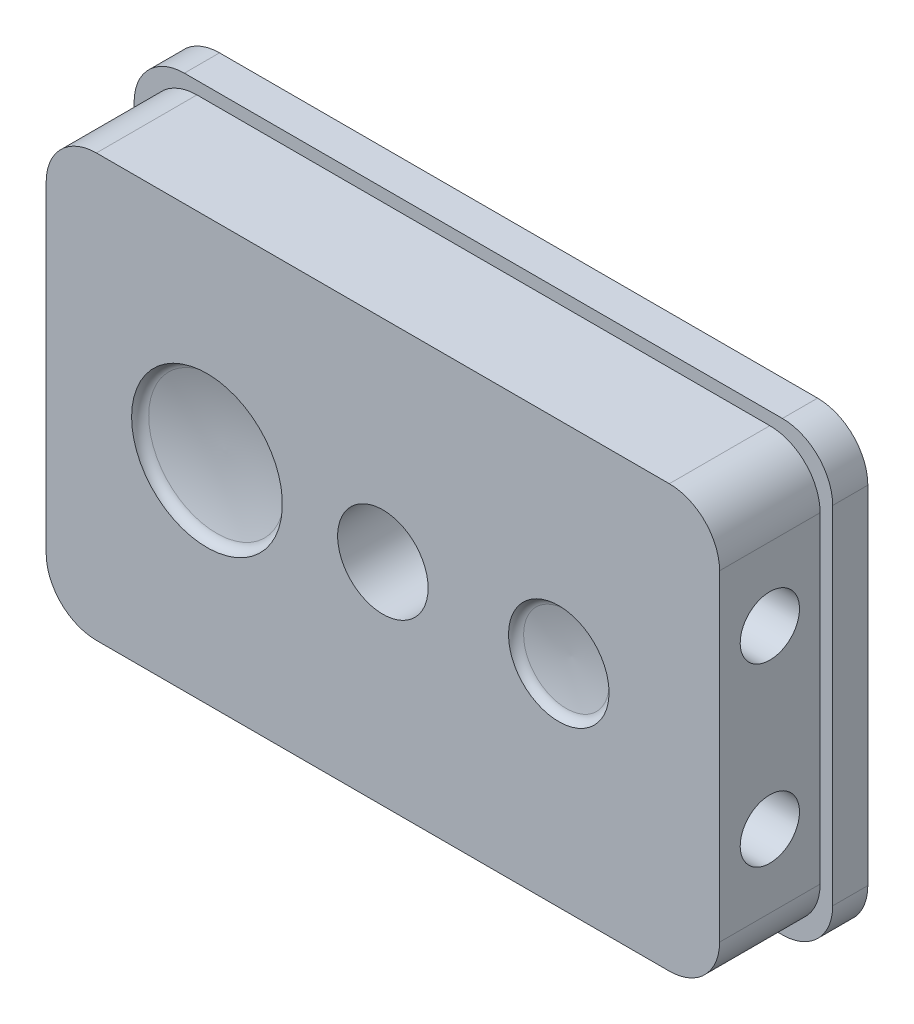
ISO-10303-21;
HEADER;
FILE_DESCRIPTION(('STEP AP214'),'2;1');
FILE_NAME('part.step','',(''),(''),'','','');
FILE_SCHEMA(('AUTOMOTIVE_DESIGN { 1 0 10303 214 1 1 1 1 }'));
ENDSEC;
DATA;
#1=APPLICATION_CONTEXT('core data for automotive mechanical design processes');
#2=APPLICATION_PROTOCOL_DEFINITION('international standard','automotive_design',2000,#1);
#3=PRODUCT_CONTEXT('',#1,'mechanical');
#4=PRODUCT('Part','Part','',(#3));
#5=PRODUCT_RELATED_PRODUCT_CATEGORY('part','',(#4));
#6=PRODUCT_DEFINITION_FORMATION('','',#4);
#7=PRODUCT_DEFINITION_CONTEXT('part definition',#1,'design');
#8=PRODUCT_DEFINITION('design','',#6,#7);
#9=PRODUCT_DEFINITION_SHAPE('','',#8);
#10=(LENGTH_UNIT() NAMED_UNIT(*) SI_UNIT(.MILLI.,.METRE.));
#11=(NAMED_UNIT(*) PLANE_ANGLE_UNIT() SI_UNIT($,.RADIAN.));
#12=(NAMED_UNIT(*) SI_UNIT($,.STERADIAN.) SOLID_ANGLE_UNIT());
#13=UNCERTAINTY_MEASURE_WITH_UNIT(LENGTH_MEASURE(1.E-05),#10,'distance_accuracy_value','');
#14=(GEOMETRIC_REPRESENTATION_CONTEXT(3) GLOBAL_UNCERTAINTY_ASSIGNED_CONTEXT((#13)) GLOBAL_UNIT_ASSIGNED_CONTEXT((#10,
#11,#12)) REPRESENTATION_CONTEXT('',''));
#15=CARTESIAN_POINT('',(0.,0.,0.));
#16=DIRECTION('',(0.,0.,1.));
#17=DIRECTION('',(1.,0.,0.));
#18=AXIS2_PLACEMENT_3D('',#15,#16,#17);
#19=CARTESIAN_POINT('',(-67.,42.,27.));
#20=DIRECTION('',(0.,0.,1.));
#21=DIRECTION('',(1.,0.,0.));
#22=AXIS2_PLACEMENT_3D('',#19,#20,#21);
#23=PLANE('',#22);
#24=CARTESIAN_POINT('',(35.,0.,27.));
#25=DIRECTION('',(0.,0.,-1.));
#26=DIRECTION('',(-1.,0.,0.));
#27=AXIS2_PLACEMENT_3D('',#24,#25,#26);
#28=CIRCLE('',#27,10.);
#29=CARTESIAN_POINT('',(25.,0.,27.));
#30=VERTEX_POINT('',#29);
#31=EDGE_CURVE('E232',#30,#30,#28,.T.);
#32=ORIENTED_EDGE('',*,*,#31,.T.);
#33=EDGE_LOOP('',(#32));
#34=FACE_BOUND('',#33,.T.);
#35=CARTESIAN_POINT('',(0.,0.,27.));
#36=DIRECTION('',(0.,0.,1.));
#37=DIRECTION('',(1.,0.,0.));
#38=AXIS2_PLACEMENT_3D('',#35,#36,#37);
#39=CIRCLE('',#38,9.);
#40=CARTESIAN_POINT('',(9.,0.,27.));
#41=VERTEX_POINT('',#40);
#42=EDGE_CURVE('E327',#41,#41,#39,.T.);
#43=ORIENTED_EDGE('',*,*,#42,.F.);
#44=EDGE_LOOP('',(#43));
#45=FACE_BOUND('',#44,.T.);
#46=DIRECTION('',(-1.,0.,0.));
#47=VECTOR('',#46,1.);
#48=CARTESIAN_POINT('',(-67.,42.,27.));
#49=LINE('',#48,#47);
#50=CARTESIAN_POINT('',(57.,42.,27.));
#51=VERTEX_POINT('',#50);
#52=CARTESIAN_POINT('',(-57.,42.,27.));
#53=VERTEX_POINT('',#52);
#54=EDGE_CURVE('E354',#51,#53,#49,.T.);
#55=ORIENTED_EDGE('',*,*,#54,.T.);
#56=CARTESIAN_POINT('',(-57.,32.,27.));
#57=DIRECTION('',(0.,0.,1.));
#58=DIRECTION('',(1.,0.,0.));
#59=AXIS2_PLACEMENT_3D('',#56,#57,#58);
#60=CIRCLE('',#59,10.);
#61=CARTESIAN_POINT('',(-67.,32.,27.));
#62=VERTEX_POINT('',#61);
#63=EDGE_CURVE('E397',#53,#62,#60,.T.);
#64=ORIENTED_EDGE('',*,*,#63,.T.);
#65=DIRECTION('',(0.,-1.,0.));
#66=VECTOR('',#65,1.);
#67=CARTESIAN_POINT('',(-67.,42.,27.));
#68=LINE('',#67,#66);
#69=CARTESIAN_POINT('',(-67.,-32.,27.));
#70=VERTEX_POINT('',#69);
#71=EDGE_CURVE('E345',#62,#70,#68,.T.);
#72=ORIENTED_EDGE('',*,*,#71,.T.);
#73=CARTESIAN_POINT('',(-57.,-32.,27.));
#74=DIRECTION('',(0.,0.,1.));
#75=DIRECTION('',(1.,0.,0.));
#76=AXIS2_PLACEMENT_3D('',#73,#74,#75);
#77=CIRCLE('',#76,10.);
#78=CARTESIAN_POINT('',(-57.,-42.,27.));
#79=VERTEX_POINT('',#78);
#80=EDGE_CURVE('E395',#70,#79,#77,.T.);
#81=ORIENTED_EDGE('',*,*,#80,.T.);
#82=DIRECTION('',(1.,0.,0.));
#83=VECTOR('',#82,1.);
#84=CARTESIAN_POINT('',(-67.,-42.,27.));
#85=LINE('',#84,#83);
#86=CARTESIAN_POINT('',(57.,-42.,27.));
#87=VERTEX_POINT('',#86);
#88=EDGE_CURVE('E348',#79,#87,#85,.T.);
#89=ORIENTED_EDGE('',*,*,#88,.T.);
#90=CARTESIAN_POINT('',(57.,-32.,27.));
#91=DIRECTION('',(0.,0.,1.));
#92=DIRECTION('',(1.,0.,0.));
#93=AXIS2_PLACEMENT_3D('',#90,#91,#92);
#94=CIRCLE('',#93,10.);
#95=CARTESIAN_POINT('',(67.,-32.,27.));
#96=VERTEX_POINT('',#95);
#97=EDGE_CURVE('E391',#87,#96,#94,.T.);
#98=ORIENTED_EDGE('',*,*,#97,.T.);
#99=DIRECTION('',(0.,1.,0.));
#100=VECTOR('',#99,1.);
#101=CARTESIAN_POINT('',(67.,42.,27.));
#102=LINE('',#101,#100);
#103=CARTESIAN_POINT('',(67.,32.,27.));
#104=VERTEX_POINT('',#103);
#105=EDGE_CURVE('E351',#96,#104,#102,.T.);
#106=ORIENTED_EDGE('',*,*,#105,.T.);
#107=CARTESIAN_POINT('',(57.,32.,27.));
#108=DIRECTION('',(0.,0.,1.));
#109=DIRECTION('',(1.,0.,0.));
#110=AXIS2_PLACEMENT_3D('',#107,#108,#109);
#111=CIRCLE('',#110,10.);
#112=EDGE_CURVE('E393',#104,#51,#111,.T.);
#113=ORIENTED_EDGE('',*,*,#112,.T.);
#114=EDGE_LOOP('',(#55,#64,#72,#81,#89,#98,#106,#113));
#115=FACE_BOUND('',#114,.T.);
#116=CARTESIAN_POINT('',(-35.,0.,27.));
#117=DIRECTION('',(0.,0.,-1.));
#118=DIRECTION('',(-1.,0.,0.));
#119=AXIS2_PLACEMENT_3D('',#116,#117,#118);
#120=CIRCLE('',#119,15.);
#121=CARTESIAN_POINT('',(-50.,0.,27.));
#122=VERTEX_POINT('',#121);
#123=EDGE_CURVE('E233',#122,#122,#120,.T.);
#124=ORIENTED_EDGE('',*,*,#123,.T.);
#125=EDGE_LOOP('',(#124));
#126=FACE_BOUND('',#125,.T.);
#127=ADVANCED_FACE('F45',(#34,#45,#115,#126),#23,.T.);
#128=CARTESIAN_POINT('',(69.5,17.5,17.));
#129=DIRECTION('',(-1.,0.,0.));
#130=DIRECTION('',(0.,-1.,0.));
#131=AXIS2_PLACEMENT_3D('',#128,#129,#130);
#132=CYLINDRICAL_SURFACE('',#131,4.);
#133=CARTESIAN_POINT('',(52.5,17.5,17.));
#134=DIRECTION('',(-0.707106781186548,0.707106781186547,0.));
#135=DIRECTION('',(-0.707106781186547,-0.707106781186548,0.));
#136=AXIS2_PLACEMENT_3D('',#133,#134,#135);
#137=ELLIPSE('',#136,5.65685424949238,4.);
#138=CARTESIAN_POINT('',(52.5,17.5,21.));
#139=VERTEX_POINT('',#138);
#140=CARTESIAN_POINT('',(52.5,17.5,13.));
#141=VERTEX_POINT('',#140);
#142=EDGE_CURVE('E298',#139,#141,#137,.T.);
#143=ORIENTED_EDGE('',*,*,#142,.T.);
#144=CARTESIAN_POINT('',(52.5,17.5,17.));
#145=DIRECTION('',(-0.707106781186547,-0.707106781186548,0.));
#146=DIRECTION('',(-0.707106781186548,0.707106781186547,0.));
#147=AXIS2_PLACEMENT_3D('',#144,#145,#146);
#148=ELLIPSE('',#147,5.65685424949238,4.);
#149=EDGE_CURVE('E301',#141,#139,#148,.T.);
#150=ORIENTED_EDGE('',*,*,#149,.T.);
#151=EDGE_LOOP('',(#143,#150));
#152=FACE_BOUND('',#151,.T.);
#153=CARTESIAN_POINT('',(57.,17.5,17.));
#154=DIRECTION('',(1.,0.,0.));
#155=DIRECTION('',(0.,1.,0.));
#156=AXIS2_PLACEMENT_3D('',#153,#154,#155);
#157=CIRCLE('',#156,4.);
#158=CARTESIAN_POINT('',(57.,21.5,17.));
#159=VERTEX_POINT('',#158);
#160=EDGE_CURVE('E49',#159,#159,#157,.F.);
#161=ORIENTED_EDGE('',*,*,#160,.F.);
#162=EDGE_LOOP('',(#161));
#163=FACE_BOUND('',#162,.T.);
#164=ADVANCED_FACE('F654',(#152,#163),#132,.F.);
#165=CARTESIAN_POINT('',(9.5,-17.5,17.));
#166=DIRECTION('',(1.,0.,0.));
#167=DIRECTION('',(0.,1.,0.));
#168=AXIS2_PLACEMENT_3D('',#165,#166,#167);
#169=CYLINDRICAL_SURFACE('',#168,4.);
#170=CARTESIAN_POINT('',(52.5,-17.5,17.));
#171=DIRECTION('',(0.707106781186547,0.707106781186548,0.));
#172=DIRECTION('',(0.707106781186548,-0.707106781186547,0.));
#173=AXIS2_PLACEMENT_3D('',#170,#171,#172);
#174=ELLIPSE('',#173,5.65685424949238,4.);
#175=CARTESIAN_POINT('',(52.5,-17.5,13.));
#176=VERTEX_POINT('',#175);
#177=CARTESIAN_POINT('',(52.5,-17.5,21.));
#178=VERTEX_POINT('',#177);
#179=EDGE_CURVE('E467',#176,#178,#174,.F.);
#180=ORIENTED_EDGE('',*,*,#179,.T.);
#181=CARTESIAN_POINT('',(52.5,-17.5,17.));
#182=DIRECTION('',(0.707106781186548,-0.707106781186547,0.));
#183=DIRECTION('',(0.707106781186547,0.707106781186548,0.));
#184=AXIS2_PLACEMENT_3D('',#181,#182,#183);
#185=ELLIPSE('',#184,5.65685424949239,4.);
#186=EDGE_CURVE('E475',#178,#176,#185,.F.);
#187=ORIENTED_EDGE('',*,*,#186,.T.);
#188=EDGE_LOOP('',(#180,#187));
#189=FACE_BOUND('',#188,.T.);
#190=CARTESIAN_POINT('',(57.,-17.5,17.));
#191=DIRECTION('',(1.,0.,0.));
#192=DIRECTION('',(0.,1.,0.));
#193=AXIS2_PLACEMENT_3D('',#190,#191,#192);
#194=CIRCLE('',#193,4.);
#195=CARTESIAN_POINT('',(57.,-13.5,17.));
#196=VERTEX_POINT('',#195);
#197=EDGE_CURVE('E255',#196,#196,#194,.F.);
#198=ORIENTED_EDGE('',*,*,#197,.F.);
#199=EDGE_LOOP('',(#198));
#200=FACE_BOUND('',#199,.T.);
#201=ADVANCED_FACE('F535',(#189,#200),#169,.F.);
#202=CARTESIAN_POINT('',(-52.5,25.5,17.));
#203=DIRECTION('',(0.,-1.,0.));
#204=DIRECTION('',(1.,0.,0.));
#205=AXIS2_PLACEMENT_3D('',#202,#203,#204);
#206=CYLINDRICAL_SURFACE('',#205,4.00000000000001);
#207=CARTESIAN_POINT('',(-52.5,-17.5,17.));
#208=DIRECTION('',(-0.707106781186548,0.707106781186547,0.));
#209=DIRECTION('',(-0.707106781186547,-0.707106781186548,0.));
#210=AXIS2_PLACEMENT_3D('',#207,#208,#209);
#211=ELLIPSE('',#210,5.65685424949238,4.);
#212=CARTESIAN_POINT('',(-52.5,-17.5,21.));
#213=VERTEX_POINT('',#212);
#214=CARTESIAN_POINT('',(-52.5,-17.5,13.));
#215=VERTEX_POINT('',#214);
#216=EDGE_CURVE('E456',#213,#215,#211,.F.);
#217=ORIENTED_EDGE('',*,*,#216,.F.);
#218=CARTESIAN_POINT('',(-52.5,-17.5,17.));
#219=DIRECTION('',(-0.707106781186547,-0.707106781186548,0.));
#220=DIRECTION('',(-0.707106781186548,0.707106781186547,0.));
#221=AXIS2_PLACEMENT_3D('',#218,#219,#220);
#222=ELLIPSE('',#221,5.65685424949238,4.);
#223=EDGE_CURVE('E461',#215,#213,#222,.T.);
#224=ORIENTED_EDGE('',*,*,#223,.F.);
#225=EDGE_LOOP('',(#217,#224));
#226=FACE_BOUND('',#225,.T.);
#227=CARTESIAN_POINT('',(-52.5,-32.,17.));
#228=DIRECTION('',(0.,-1.,0.));
#229=DIRECTION('',(1.,0.,0.));
#230=AXIS2_PLACEMENT_3D('',#227,#228,#229);
#231=CIRCLE('',#230,4.00000000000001);
#232=CARTESIAN_POINT('',(-48.5,-32.,17.));
#233=VERTEX_POINT('',#232);
#234=EDGE_CURVE('E260',#233,#233,#231,.F.);
#235=ORIENTED_EDGE('',*,*,#234,.F.);
#236=EDGE_LOOP('',(#235));
#237=FACE_BOUND('',#236,.T.);
#238=ADVANCED_FACE('F526',(#226,#237),#206,.F.);
#239=CARTESIAN_POINT('',(52.5,25.5,17.));
#240=DIRECTION('',(0.,-1.,0.));
#241=DIRECTION('',(1.,0.,0.));
#242=AXIS2_PLACEMENT_3D('',#239,#240,#241);
#243=CYLINDRICAL_SURFACE('',#242,4.00000000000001);
#244=ORIENTED_EDGE('',*,*,#179,.F.);
#245=CARTESIAN_POINT('',(52.5,-17.5,17.));
#246=DIRECTION('',(0.707106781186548,-0.707106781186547,0.));
#247=DIRECTION('',(0.707106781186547,0.707106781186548,0.));
#248=AXIS2_PLACEMENT_3D('',#245,#246,#247);
#249=ELLIPSE('',#248,5.65685424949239,4.);
#250=EDGE_CURVE('E472',#178,#176,#249,.T.);
#251=ORIENTED_EDGE('',*,*,#250,.F.);
#252=EDGE_LOOP('',(#244,#251));
#253=FACE_BOUND('',#252,.T.);
#254=CARTESIAN_POINT('',(52.5,-32.,17.));
#255=DIRECTION('',(0.,-1.,0.));
#256=DIRECTION('',(1.,0.,0.));
#257=AXIS2_PLACEMENT_3D('',#254,#255,#256);
#258=CIRCLE('',#257,4.00000000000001);
#259=CARTESIAN_POINT('',(56.5,-32.,17.));
#260=VERTEX_POINT('',#259);
#261=EDGE_CURVE('E265',#260,#260,#258,.F.);
#262=ORIENTED_EDGE('',*,*,#261,.F.);
#263=EDGE_LOOP('',(#262));
#264=FACE_BOUND('',#263,.T.);
#265=ADVANCED_FACE('F515',(#253,#264),#243,.F.);
#266=CARTESIAN_POINT('',(-9.5,-17.5,17.));
#267=DIRECTION('',(-1.,0.,0.));
#268=DIRECTION('',(0.,-1.,0.));
#269=AXIS2_PLACEMENT_3D('',#266,#267,#268);
#270=CYLINDRICAL_SURFACE('',#269,4.);
#271=ORIENTED_EDGE('',*,*,#216,.T.);
#272=CARTESIAN_POINT('',(-52.5,-17.5,17.));
#273=DIRECTION('',(-0.707106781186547,-0.707106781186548,0.));
#274=DIRECTION('',(-0.707106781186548,0.707106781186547,0.));
#275=AXIS2_PLACEMENT_3D('',#272,#273,#274);
#276=ELLIPSE('',#275,5.65685424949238,4.);
#277=EDGE_CURVE('E464',#215,#213,#276,.F.);
#278=ORIENTED_EDGE('',*,*,#277,.T.);
#279=EDGE_LOOP('',(#271,#278));
#280=FACE_BOUND('',#279,.T.);
#281=CARTESIAN_POINT('',(-57.,-17.5,17.));
#282=DIRECTION('',(-1.,0.,0.));
#283=DIRECTION('',(0.,-1.,0.));
#284=AXIS2_PLACEMENT_3D('',#281,#282,#283);
#285=CIRCLE('',#284,4.);
#286=CARTESIAN_POINT('',(-57.,-21.5,17.));
#287=VERTEX_POINT('',#286);
#288=EDGE_CURVE('E272',#287,#287,#285,.F.);
#289=ORIENTED_EDGE('',*,*,#288,.F.);
#290=EDGE_LOOP('',(#289));
#291=FACE_BOUND('',#290,.T.);
#292=ADVANCED_FACE('F831',(#280,#291),#270,.F.);
#293=CARTESIAN_POINT('',(-52.5,17.5,17.));
#294=DIRECTION('',(-0.707106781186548,0.707106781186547,0.));
#295=DIRECTION('',(-0.707106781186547,-0.707106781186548,0.));
#296=AXIS2_PLACEMENT_3D('',#293,#294,#295);
#297=ELLIPSE('',#296,5.65685424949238,4.);
#298=CARTESIAN_POINT('',(-52.5,17.5,21.));
#299=VERTEX_POINT('',#298);
#300=CARTESIAN_POINT('',(-52.5,17.5,13.));
#301=VERTEX_POINT('',#300);
#302=EDGE_CURVE('E310',#299,#301,#297,.F.);
#303=ORIENTED_EDGE('',*,*,#302,.T.);
#304=CARTESIAN_POINT('',(-52.5,17.5,17.));
#305=DIRECTION('',(-0.707106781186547,-0.707106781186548,0.));
#306=DIRECTION('',(-0.707106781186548,0.707106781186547,0.));
#307=AXIS2_PLACEMENT_3D('',#304,#305,#306);
#308=ELLIPSE('',#307,5.65685424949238,4.);
#309=EDGE_CURVE('E318',#301,#299,#308,.F.);
#310=ORIENTED_EDGE('',*,*,#309,.T.);
#311=EDGE_LOOP('',(#303,#310));
#312=FACE_BOUND('',#311,.T.);
#313=CARTESIAN_POINT('',(-57.,17.5,17.));
#314=DIRECTION('',(-1.,0.,0.));
#315=DIRECTION('',(0.,-1.,0.));
#316=AXIS2_PLACEMENT_3D('',#313,#314,#315);
#317=CIRCLE('',#316,4.);
#318=CARTESIAN_POINT('',(-57.,13.5,17.));
#319=VERTEX_POINT('',#318);
#320=EDGE_CURVE('E279',#319,#319,#317,.F.);
#321=ORIENTED_EDGE('',*,*,#320,.F.);
#322=EDGE_LOOP('',(#321));
#323=FACE_BOUND('',#322,.T.);
#324=ADVANCED_FACE('F533',(#312,#323),#132,.F.);
#325=CARTESIAN_POINT('',(9.5,-17.5,17.));
#326=DIRECTION('',(1.,0.,0.));
#327=DIRECTION('',(0.,1.,0.));
#328=AXIS2_PLACEMENT_3D('',#325,#326,#327);
#329=CIRCLE('',#328,4.);
#330=CARTESIAN_POINT('',(9.5,-13.5,17.));
#331=VERTEX_POINT('',#330);
#332=EDGE_CURVE('E321',#331,#331,#329,.T.);
#333=ORIENTED_EDGE('',*,*,#332,.F.);
#334=EDGE_LOOP('',(#333));
#335=FACE_BOUND('',#334,.T.);
#336=CARTESIAN_POINT('',(52.5,-17.5,17.));
#337=DIRECTION('',(0.707106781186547,0.707106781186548,0.));
#338=DIRECTION('',(0.707106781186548,-0.707106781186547,0.));
#339=AXIS2_PLACEMENT_3D('',#336,#337,#338);
#340=ELLIPSE('',#339,5.65685424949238,4.);
#341=EDGE_CURVE('E469',#176,#178,#340,.T.);
#342=ORIENTED_EDGE('',*,*,#341,.T.);
#343=ORIENTED_EDGE('',*,*,#250,.T.);
#344=EDGE_LOOP('',(#342,#343));
#345=FACE_BOUND('',#344,.T.);
#346=DIRECTION('',(1.,0.,0.));
#347=VECTOR('',#346,1.);
#348=CARTESIAN_POINT('',(9.5,-17.5,13.));
#349=LINE('',#348,#347);
#350=CARTESIAN_POINT('',(21.8370496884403,-17.5,13.));
#351=VERTEX_POINT('',#350);
#352=CARTESIAN_POINT('',(13.1629503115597,-17.5,13.));
#353=VERTEX_POINT('',#352);
#354=EDGE_CURVE('E551',#351,#353,#349,.F.);
#355=ORIENTED_EDGE('',*,*,#354,.F.);
#356=CARTESIAN_POINT('',(21.8370496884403,-17.5,13.));
#357=CARTESIAN_POINT('',(21.8369932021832,-17.5978143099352,12.9999737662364));
#358=CARTESIAN_POINT('',(21.8403572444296,-17.6955930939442,13.0035866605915));
#359=CARTESIAN_POINT('',(21.8534908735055,-17.8900650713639,13.0178793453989));
#360=CARTESIAN_POINT('',(21.863251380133,-17.986759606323,13.0285491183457));
#361=CARTESIAN_POINT('',(21.888614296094,-18.1773507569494,13.0566010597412));
#362=CARTESIAN_POINT('',(21.9041559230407,-18.271265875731,13.0739134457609));
#363=CARTESIAN_POINT('',(21.9403781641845,-18.4566760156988,13.1149267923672));
#364=CARTESIAN_POINT('',(21.961060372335,-18.5481702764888,13.1386297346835));
#365=CARTESIAN_POINT('',(22.0293659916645,-18.8172348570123,13.2185019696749));
#366=CARTESIAN_POINT('',(22.0834266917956,-18.99059249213,13.2836189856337));
#367=CARTESIAN_POINT('',(22.2023903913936,-19.3239813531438,13.4353370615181));
#368=CARTESIAN_POINT('',(22.2673250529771,-19.483971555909,13.5220012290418));
#369=CARTESIAN_POINT('',(22.4131111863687,-19.8138570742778,13.7304428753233));
#370=CARTESIAN_POINT('',(22.4948435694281,-19.9812123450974,13.855625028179));
#371=CARTESIAN_POINT('',(22.6577849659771,-20.2947582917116,14.1307127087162));
#372=CARTESIAN_POINT('',(22.7389936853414,-20.4409379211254,14.2806310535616));
#373=CARTESIAN_POINT('',(22.8614448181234,-20.6526244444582,14.5351235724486));
#374=CARTESIAN_POINT('',(22.9050569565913,-20.7260920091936,14.6320382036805));
#375=CARTESIAN_POINT('',(22.9887818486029,-20.8644864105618,14.8331766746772));
#376=CARTESIAN_POINT('',(23.0288961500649,-20.929417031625,14.9373972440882));
#377=CARTESIAN_POINT('',(23.1044577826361,-21.0499504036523,15.1525605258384));
#378=CARTESIAN_POINT('',(23.1399102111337,-21.1055633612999,15.2634956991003));
#379=CARTESIAN_POINT('',(23.2051039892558,-21.2067103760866,15.4914075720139));
#380=CARTESIAN_POINT('',(23.2348476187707,-21.2522484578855,15.6083818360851));
#381=CARTESIAN_POINT('',(23.3005277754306,-21.3520347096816,15.9059370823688));
#382=CARTESIAN_POINT('',(23.332409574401,-21.399698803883,16.0897155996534));
#383=CARTESIAN_POINT('',(23.3786456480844,-21.468516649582,16.4641911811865));
#384=CARTESIAN_POINT('',(23.3930135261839,-21.4896909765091,16.6548827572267));
#385=CARTESIAN_POINT('',(23.4029936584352,-21.5044184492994,17.0381733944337));
#386=CARTESIAN_POINT('',(23.398574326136,-21.4979250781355,17.2307751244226));
#387=CARTESIAN_POINT('',(23.3713079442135,-21.4575842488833,17.6117635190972));
#388=CARTESIAN_POINT('',(23.3484554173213,-21.4237286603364,17.8001489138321));
#389=CARTESIAN_POINT('',(23.2868905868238,-21.3313520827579,18.1642169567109));
#390=CARTESIAN_POINT('',(23.2484734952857,-21.2732896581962,18.3400680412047));
#391=CARTESIAN_POINT('',(23.1587067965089,-21.1350679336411,18.6792427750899));
#392=CARTESIAN_POINT('',(23.1073548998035,-21.0549047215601,18.8425642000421));
#393=CARTESIAN_POINT('',(22.9887506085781,-20.8648947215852,19.1720080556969));
#394=CARTESIAN_POINT('',(22.9203583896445,-20.7527205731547,19.3363711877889));
#395=CARTESIAN_POINT('',(22.7766155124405,-20.5070917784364,19.6450693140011));
#396=CARTESIAN_POINT('',(22.7012566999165,-20.3736120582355,19.7893803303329));
#397=CARTESIAN_POINT('',(22.5359715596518,-20.0634169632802,20.0791641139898));
#398=CARTESIAN_POINT('',(22.4457307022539,-19.8832062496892,20.2207331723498));
#399=CARTESIAN_POINT('',(22.2724077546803,-19.498826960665,20.4723815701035));
#400=CARTESIAN_POINT('',(22.1893225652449,-19.2946688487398,20.5824745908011));
#401=CARTESIAN_POINT('',(22.0601392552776,-18.9170441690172,20.7447518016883));
#402=CARTESIAN_POINT('',(22.009965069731,-18.7482860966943,20.804513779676));
#403=CARTESIAN_POINT('',(21.9473015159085,-18.4877227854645,20.8771798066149));
#404=CARTESIAN_POINT('',(21.9285276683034,-18.3997361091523,20.8985574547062));
#405=CARTESIAN_POINT('',(21.8958110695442,-18.2216688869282,20.9354099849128));
#406=CARTESIAN_POINT('',(21.881866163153,-18.1315892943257,20.9508875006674));
#407=CARTESIAN_POINT('',(21.8596158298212,-17.9516981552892,20.9754289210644));
#408=CARTESIAN_POINT('',(21.8512048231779,-17.8619162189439,20.9846130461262));
#409=CARTESIAN_POINT('',(21.8398956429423,-17.6814323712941,20.9969139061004));
#410=CARTESIAN_POINT('',(21.837007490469,-17.5907290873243,21.0000196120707));
#411=CARTESIAN_POINT('',(21.8370496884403,-17.5,21.));
#412=B_SPLINE_CURVE_WITH_KNOTS('',3,(#356,#357,#358,#359,#360,#361,#362,#363,#364,#365,#366,
#367,#368,#369,#370,#371,#372,#373,#374,#375,#376,#377,#378,#379,#380,#381,#382,#383,#384,#385,
#386,#387,#388,#389,#390,#391,#392,#393,#394,#395,#396,#397,#398,#399,#400,#401,#402,#403,#404,
#405,#406,#407,#408,#409,#410,#411),.UNSPECIFIED.,.F.,.F.,(4,2,2,2,2,2,2,2,2,2,2,2,2,2,2,2,2,2,
2,2,2,2,2,2,2,2,2,4),(0.,0.293261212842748,0.586107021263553,0.875957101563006,1.16589716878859,
1.74212728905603,2.32006538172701,2.99087994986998,3.66204320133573,4.04917770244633,
4.43614000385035,4.82267561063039,5.20905652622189,5.78388292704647,6.35826256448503,
6.93360827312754,7.50912500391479,8.07420200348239,8.63937909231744,9.26826126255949,
9.89788907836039,10.6336376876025,11.3690660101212,11.9245975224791,12.2017264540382,
12.478731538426,12.7502853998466,13.0223315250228),.UNSPECIFIED.);
#413=CARTESIAN_POINT('',(21.8370496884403,-17.5,21.));
#414=VERTEX_POINT('',#413);
#415=EDGE_CURVE('E545',#351,#414,#412,.T.);
#416=ORIENTED_EDGE('',*,*,#415,.T.);
#417=DIRECTION('',(1.,0.,0.));
#418=VECTOR('',#417,1.);
#419=CARTESIAN_POINT('',(9.5,-17.5,21.));
#420=LINE('',#419,#418);
#421=CARTESIAN_POINT('',(13.1629503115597,-17.5,21.));
#422=VERTEX_POINT('',#421);
#423=EDGE_CURVE('E1074',#422,#414,#420,.T.);
#424=ORIENTED_EDGE('',*,*,#423,.F.);
#425=CARTESIAN_POINT('',(13.1629503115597,-17.5,21.));
#426=CARTESIAN_POINT('',(13.1630067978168,-17.5978143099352,21.0000262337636));
#427=CARTESIAN_POINT('',(13.1596427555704,-17.6955930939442,20.9964133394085));
#428=CARTESIAN_POINT('',(13.1465091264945,-17.8900650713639,20.9821206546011));
#429=CARTESIAN_POINT('',(13.1367486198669,-17.986759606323,20.9714508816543));
#430=CARTESIAN_POINT('',(13.111385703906,-18.1773507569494,20.9433989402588));
#431=CARTESIAN_POINT('',(13.0958440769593,-18.271265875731,20.9260865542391));
#432=CARTESIAN_POINT('',(13.0596218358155,-18.4566760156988,20.8850732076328));
#433=CARTESIAN_POINT('',(13.038939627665,-18.5481702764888,20.8613702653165));
#434=CARTESIAN_POINT('',(12.9706340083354,-18.8172348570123,20.7814980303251));
#435=CARTESIAN_POINT('',(12.9165733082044,-18.99059249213,20.7163810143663));
#436=CARTESIAN_POINT('',(12.7976096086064,-19.3239813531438,20.5646629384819));
#437=CARTESIAN_POINT('',(12.7326749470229,-19.483971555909,20.4779987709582));
#438=CARTESIAN_POINT('',(12.5868888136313,-19.8138570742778,20.2695571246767));
#439=CARTESIAN_POINT('',(12.5051564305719,-19.9812123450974,20.144374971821));
#440=CARTESIAN_POINT('',(12.3422150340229,-20.2947582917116,19.8692872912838));
#441=CARTESIAN_POINT('',(12.2610063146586,-20.4409379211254,19.7193689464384));
#442=CARTESIAN_POINT('',(12.1385551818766,-20.6526244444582,19.4648764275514));
#443=CARTESIAN_POINT('',(12.0949430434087,-20.7260920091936,19.3679617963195));
#444=CARTESIAN_POINT('',(12.0112181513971,-20.8644864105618,19.1668233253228));
#445=CARTESIAN_POINT('',(11.9711038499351,-20.929417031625,19.0626027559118));
#446=CARTESIAN_POINT('',(11.8955422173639,-21.0499504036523,18.8474394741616));
#447=CARTESIAN_POINT('',(11.8600897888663,-21.1055633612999,18.7365043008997));
#448=CARTESIAN_POINT('',(11.7948960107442,-21.2067103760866,18.5085924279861));
#449=CARTESIAN_POINT('',(11.7651523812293,-21.2522484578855,18.3916181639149));
#450=CARTESIAN_POINT('',(11.6994722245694,-21.3520347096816,18.0940629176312));
#451=CARTESIAN_POINT('',(11.667590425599,-21.399698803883,17.9102844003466));
#452=CARTESIAN_POINT('',(11.6213543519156,-21.468516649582,17.5358088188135));
#453=CARTESIAN_POINT('',(11.6069864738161,-21.4896909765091,17.3451172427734));
#454=CARTESIAN_POINT('',(11.5970063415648,-21.5044184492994,16.9618266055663));
#455=CARTESIAN_POINT('',(11.601425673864,-21.4979250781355,16.7692248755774));
#456=CARTESIAN_POINT('',(11.6286920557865,-21.4575842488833,16.3882364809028));
#457=CARTESIAN_POINT('',(11.6515445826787,-21.4237286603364,16.1998510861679));
#458=CARTESIAN_POINT('',(11.7131094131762,-21.3313520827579,15.8357830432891));
#459=CARTESIAN_POINT('',(11.7515265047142,-21.2732896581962,15.6599319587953));
#460=CARTESIAN_POINT('',(11.8412932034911,-21.1350679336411,15.3207572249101));
#461=CARTESIAN_POINT('',(11.8926451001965,-21.0549047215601,15.1574357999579));
#462=CARTESIAN_POINT('',(12.0112493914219,-20.8648947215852,14.8279919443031));
#463=CARTESIAN_POINT('',(12.0796416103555,-20.7527205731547,14.6636288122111));
#464=CARTESIAN_POINT('',(12.2233844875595,-20.5070917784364,14.3549306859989));
#465=CARTESIAN_POINT('',(12.2987433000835,-20.3736120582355,14.2106196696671));
#466=CARTESIAN_POINT('',(12.4640284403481,-20.0634169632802,13.9208358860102));
#467=CARTESIAN_POINT('',(12.5542692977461,-19.8832062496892,13.7792668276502));
#468=CARTESIAN_POINT('',(12.7275922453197,-19.498826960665,13.5276184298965));
#469=CARTESIAN_POINT('',(12.8106774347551,-19.2946688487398,13.4175254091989));
#470=CARTESIAN_POINT('',(12.9398607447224,-18.9170441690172,13.2552481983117));
#471=CARTESIAN_POINT('',(12.990034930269,-18.7482860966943,13.195486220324));
#472=CARTESIAN_POINT('',(13.0526984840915,-18.4877227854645,13.1228201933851));
#473=CARTESIAN_POINT('',(13.0714723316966,-18.3997361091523,13.1014425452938));
#474=CARTESIAN_POINT('',(13.1041889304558,-18.2216688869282,13.0645900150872));
#475=CARTESIAN_POINT('',(13.118133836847,-18.1315892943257,13.0491124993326));
#476=CARTESIAN_POINT('',(13.1403841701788,-17.9516981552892,13.0245710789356));
#477=CARTESIAN_POINT('',(13.1487951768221,-17.8619162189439,13.0153869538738));
#478=CARTESIAN_POINT('',(13.1601043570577,-17.6814323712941,13.0030860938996));
#479=CARTESIAN_POINT('',(13.162992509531,-17.5907290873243,12.9999803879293));
#480=CARTESIAN_POINT('',(13.1629503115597,-17.5,13.));
#481=B_SPLINE_CURVE_WITH_KNOTS('',3,(#425,#426,#427,#428,#429,#430,#431,#432,#433,#434,#435,
#436,#437,#438,#439,#440,#441,#442,#443,#444,#445,#446,#447,#448,#449,#450,#451,#452,#453,#454,
#455,#456,#457,#458,#459,#460,#461,#462,#463,#464,#465,#466,#467,#468,#469,#470,#471,#472,#473,
#474,#475,#476,#477,#478,#479,#480),.UNSPECIFIED.,.F.,.F.,(4,2,2,2,2,2,2,2,2,2,2,2,2,2,2,2,2,2,
2,2,2,2,2,2,2,2,2,4),(0.,0.293261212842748,0.586107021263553,0.875957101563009,1.16589716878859,
1.74212728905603,2.320065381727,2.99087994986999,3.66204320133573,4.04917770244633,
4.43614000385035,4.82267561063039,5.20905652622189,5.78388292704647,6.35826256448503,
6.93360827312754,7.50912500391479,8.07420200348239,8.63937909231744,9.26826126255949,
9.89788907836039,10.6336376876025,11.3690660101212,11.9245975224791,12.2017264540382,
12.478731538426,12.7502853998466,13.0223315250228),.UNSPECIFIED.);
#482=EDGE_CURVE('E539',#422,#353,#481,.T.);
#483=ORIENTED_EDGE('',*,*,#482,.T.);
#484=EDGE_LOOP('',(#355,#416,#424,#483));
#485=FACE_BOUND('',#484,.T.);
#486=ADVANCED_FACE('F530',(#335,#345,#485),#169,.F.);
#487=CARTESIAN_POINT('',(-9.5,-17.5,17.));
#488=DIRECTION('',(-1.,0.,0.));
#489=DIRECTION('',(0.,-1.,0.));
#490=AXIS2_PLACEMENT_3D('',#487,#488,#489);
#491=CIRCLE('',#490,4.);
#492=CARTESIAN_POINT('',(-9.5,-21.5,17.));
#493=VERTEX_POINT('',#492);
#494=EDGE_CURVE('E324',#493,#493,#491,.T.);
#495=ORIENTED_EDGE('',*,*,#494,.F.);
#496=EDGE_LOOP('',(#495));
#497=FACE_BOUND('',#496,.T.);
#498=CARTESIAN_POINT('',(-52.5,-17.5,17.));
#499=DIRECTION('',(-0.707106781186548,0.707106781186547,0.));
#500=DIRECTION('',(-0.707106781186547,-0.707106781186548,0.));
#501=AXIS2_PLACEMENT_3D('',#498,#499,#500);
#502=ELLIPSE('',#501,5.65685424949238,4.);
#503=EDGE_CURVE('E458',#213,#215,#502,.T.);
#504=ORIENTED_EDGE('',*,*,#503,.T.);
#505=ORIENTED_EDGE('',*,*,#223,.T.);
#506=EDGE_LOOP('',(#504,#505));
#507=FACE_BOUND('',#506,.T.);
#508=DIRECTION('',(-1.,0.,0.));
#509=VECTOR('',#508,1.);
#510=CARTESIAN_POINT('',(-9.5,-17.5,21.));
#511=LINE('',#510,#509);
#512=CARTESIAN_POINT('',(-21.8370496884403,-17.5,21.));
#513=VERTEX_POINT('',#512);
#514=CARTESIAN_POINT('',(-13.1629503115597,-17.5,21.));
#515=VERTEX_POINT('',#514);
#516=EDGE_CURVE('E1070',#513,#515,#511,.F.);
#517=ORIENTED_EDGE('',*,*,#516,.F.);
#518=CARTESIAN_POINT('',(-21.8370496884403,-17.5,21.));
#519=CARTESIAN_POINT('',(-21.8369932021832,-17.5978143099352,21.0000262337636));
#520=CARTESIAN_POINT('',(-21.8403572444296,-17.6955930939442,20.9964133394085));
#521=CARTESIAN_POINT('',(-21.8534908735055,-17.8900650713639,20.9821206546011));
#522=CARTESIAN_POINT('',(-21.8632513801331,-17.986759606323,20.9714508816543));
#523=CARTESIAN_POINT('',(-21.888614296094,-18.1773507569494,20.9433989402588));
#524=CARTESIAN_POINT('',(-21.9041559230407,-18.271265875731,20.9260865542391));
#525=CARTESIAN_POINT('',(-21.9403781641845,-18.4566760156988,20.8850732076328));
#526=CARTESIAN_POINT('',(-21.961060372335,-18.5481702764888,20.8613702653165));
#527=CARTESIAN_POINT('',(-22.0293659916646,-18.8172348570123,20.7814980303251));
#528=CARTESIAN_POINT('',(-22.0834266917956,-18.99059249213,20.7163810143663));
#529=CARTESIAN_POINT('',(-22.2023903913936,-19.3239813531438,20.5646629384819));
#530=CARTESIAN_POINT('',(-22.2673250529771,-19.483971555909,20.4779987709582));
#531=CARTESIAN_POINT('',(-22.4131111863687,-19.8138570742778,20.2695571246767));
#532=CARTESIAN_POINT('',(-22.4948435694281,-19.9812123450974,20.144374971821));
#533=CARTESIAN_POINT('',(-22.6577849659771,-20.2947582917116,19.8692872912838));
#534=CARTESIAN_POINT('',(-22.7389936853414,-20.4409379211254,19.7193689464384));
#535=CARTESIAN_POINT('',(-22.8614448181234,-20.6526244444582,19.4648764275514));
#536=CARTESIAN_POINT('',(-22.9050569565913,-20.7260920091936,19.3679617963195));
#537=CARTESIAN_POINT('',(-22.9887818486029,-20.8644864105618,19.1668233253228));
#538=CARTESIAN_POINT('',(-23.0288961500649,-20.929417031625,19.0626027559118));
#539=CARTESIAN_POINT('',(-23.1044577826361,-21.0499504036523,18.8474394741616));
#540=CARTESIAN_POINT('',(-23.1399102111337,-21.1055633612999,18.7365043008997));
#541=CARTESIAN_POINT('',(-23.2051039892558,-21.2067103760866,18.5085924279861));
#542=CARTESIAN_POINT('',(-23.2348476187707,-21.2522484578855,18.3916181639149));
#543=CARTESIAN_POINT('',(-23.3005277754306,-21.3520347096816,18.0940629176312));
#544=CARTESIAN_POINT('',(-23.332409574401,-21.399698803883,17.9102844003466));
#545=CARTESIAN_POINT('',(-23.3786456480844,-21.468516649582,17.5358088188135));
#546=CARTESIAN_POINT('',(-23.3930135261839,-21.4896909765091,17.3451172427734));
#547=CARTESIAN_POINT('',(-23.4029936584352,-21.5044184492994,16.9618266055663));
#548=CARTESIAN_POINT('',(-23.398574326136,-21.4979250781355,16.7692248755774));
#549=CARTESIAN_POINT('',(-23.3713079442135,-21.4575842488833,16.3882364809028));
#550=CARTESIAN_POINT('',(-23.3484554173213,-21.4237286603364,16.1998510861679));
#551=CARTESIAN_POINT('',(-23.2868905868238,-21.3313520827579,15.8357830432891));
#552=CARTESIAN_POINT('',(-23.2484734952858,-21.2732896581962,15.6599319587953));
#553=CARTESIAN_POINT('',(-23.1587067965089,-21.1350679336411,15.3207572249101));
#554=CARTESIAN_POINT('',(-23.1073548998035,-21.0549047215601,15.1574357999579));
#555=CARTESIAN_POINT('',(-22.9887506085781,-20.8648947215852,14.8279919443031));
#556=CARTESIAN_POINT('',(-22.9203583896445,-20.7527205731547,14.6636288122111));
#557=CARTESIAN_POINT('',(-22.7766155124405,-20.5070917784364,14.3549306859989));
#558=CARTESIAN_POINT('',(-22.7012566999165,-20.3736120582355,14.2106196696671));
#559=CARTESIAN_POINT('',(-22.5359715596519,-20.0634169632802,13.9208358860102));
#560=CARTESIAN_POINT('',(-22.4457307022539,-19.8832062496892,13.7792668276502));
#561=CARTESIAN_POINT('',(-22.2724077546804,-19.498826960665,13.5276184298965));
#562=CARTESIAN_POINT('',(-22.189322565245,-19.2946688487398,13.4175254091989));
#563=CARTESIAN_POINT('',(-22.0601392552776,-18.9170441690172,13.2552481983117));
#564=CARTESIAN_POINT('',(-22.0099650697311,-18.7482860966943,13.195486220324));
#565=CARTESIAN_POINT('',(-21.9473015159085,-18.4877227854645,13.1228201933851));
#566=CARTESIAN_POINT('',(-21.9285276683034,-18.3997361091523,13.1014425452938));
#567=CARTESIAN_POINT('',(-21.8958110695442,-18.2216688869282,13.0645900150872));
#568=CARTESIAN_POINT('',(-21.881866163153,-18.1315892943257,13.0491124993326));
#569=CARTESIAN_POINT('',(-21.8596158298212,-17.9516981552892,13.0245710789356));
#570=CARTESIAN_POINT('',(-21.8512048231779,-17.8619162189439,13.0153869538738));
#571=CARTESIAN_POINT('',(-21.8398956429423,-17.6814323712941,13.0030860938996));
#572=CARTESIAN_POINT('',(-21.837007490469,-17.5907290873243,12.9999803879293));
#573=CARTESIAN_POINT('',(-21.8370496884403,-17.5,13.));
#574=B_SPLINE_CURVE_WITH_KNOTS('',3,(#518,#519,#520,#521,#522,#523,#524,#525,#526,#527,#528,
#529,#530,#531,#532,#533,#534,#535,#536,#537,#538,#539,#540,#541,#542,#543,#544,#545,#546,#547,
#548,#549,#550,#551,#552,#553,#554,#555,#556,#557,#558,#559,#560,#561,#562,#563,#564,#565,#566,
#567,#568,#569,#570,#571,#572,#573),.UNSPECIFIED.,.F.,.F.,(4,2,2,2,2,2,2,2,2,2,2,2,2,2,2,2,2,2,
2,2,2,2,2,2,2,2,2,4),(0.,0.293261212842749,0.586107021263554,0.875957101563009,1.16589716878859,
1.74212728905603,2.320065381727,2.99087994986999,3.66204320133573,4.04917770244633,
4.43614000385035,4.82267561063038,5.20905652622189,5.78388292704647,6.35826256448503,
6.93360827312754,7.5091250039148,8.0742020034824,8.63937909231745,9.2682612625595,
9.8978890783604,10.6336376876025,11.3690660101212,11.9245975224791,12.2017264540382,
12.478731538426,12.7502853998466,13.0223315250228),.UNSPECIFIED.);
#575=CARTESIAN_POINT('',(-21.8370496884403,-17.5,13.));
#576=VERTEX_POINT('',#575);
#577=EDGE_CURVE('E480',#513,#576,#574,.T.);
#578=ORIENTED_EDGE('',*,*,#577,.T.);
#579=DIRECTION('',(-1.,0.,0.));
#580=VECTOR('',#579,1.);
#581=CARTESIAN_POINT('',(-9.5,-17.5,13.));
#582=LINE('',#581,#580);
#583=CARTESIAN_POINT('',(-13.1629503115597,-17.5,13.));
#584=VERTEX_POINT('',#583);
#585=EDGE_CURVE('E478',#584,#576,#582,.T.);
#586=ORIENTED_EDGE('',*,*,#585,.F.);
#587=CARTESIAN_POINT('',(-13.1629503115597,-17.5,13.));
#588=CARTESIAN_POINT('',(-13.1630067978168,-17.5978143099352,12.9999737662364));
#589=CARTESIAN_POINT('',(-13.1596427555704,-17.6955930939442,13.0035866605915));
#590=CARTESIAN_POINT('',(-13.1465091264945,-17.8900650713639,13.0178793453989));
#591=CARTESIAN_POINT('',(-13.1367486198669,-17.986759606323,13.0285491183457));
#592=CARTESIAN_POINT('',(-13.111385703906,-18.1773507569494,13.0566010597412));
#593=CARTESIAN_POINT('',(-13.0958440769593,-18.271265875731,13.0739134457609));
#594=CARTESIAN_POINT('',(-13.0596218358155,-18.4566760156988,13.1149267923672));
#595=CARTESIAN_POINT('',(-13.038939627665,-18.5481702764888,13.1386297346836));
#596=CARTESIAN_POINT('',(-12.9706340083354,-18.8172348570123,13.2185019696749));
#597=CARTESIAN_POINT('',(-12.9165733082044,-18.99059249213,13.2836189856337));
#598=CARTESIAN_POINT('',(-12.7976096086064,-19.3239813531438,13.4353370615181));
#599=CARTESIAN_POINT('',(-12.7326749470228,-19.483971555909,13.5220012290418));
#600=CARTESIAN_POINT('',(-12.5868888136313,-19.8138570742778,13.7304428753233));
#601=CARTESIAN_POINT('',(-12.5051564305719,-19.9812123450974,13.855625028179));
#602=CARTESIAN_POINT('',(-12.3422150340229,-20.2947582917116,14.1307127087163));
#603=CARTESIAN_POINT('',(-12.2610063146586,-20.4409379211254,14.2806310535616));
#604=CARTESIAN_POINT('',(-12.1385551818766,-20.6526244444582,14.5351235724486));
#605=CARTESIAN_POINT('',(-12.0949430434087,-20.7260920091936,14.6320382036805));
#606=CARTESIAN_POINT('',(-12.0112181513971,-20.8644864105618,14.8331766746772));
#607=CARTESIAN_POINT('',(-11.9711038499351,-20.929417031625,14.9373972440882));
#608=CARTESIAN_POINT('',(-11.8955422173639,-21.0499504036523,15.1525605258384));
#609=CARTESIAN_POINT('',(-11.8600897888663,-21.1055633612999,15.2634956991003));
#610=CARTESIAN_POINT('',(-11.7948960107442,-21.2067103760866,15.4914075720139));
#611=CARTESIAN_POINT('',(-11.7651523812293,-21.2522484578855,15.6083818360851));
#612=CARTESIAN_POINT('',(-11.6994722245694,-21.3520347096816,15.9059370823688));
#613=CARTESIAN_POINT('',(-11.667590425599,-21.399698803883,16.0897155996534));
#614=CARTESIAN_POINT('',(-11.6213543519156,-21.468516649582,16.4641911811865));
#615=CARTESIAN_POINT('',(-11.6069864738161,-21.4896909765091,16.6548827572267));
#616=CARTESIAN_POINT('',(-11.5970063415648,-21.5044184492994,17.0381733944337));
#617=CARTESIAN_POINT('',(-11.601425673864,-21.4979250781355,17.2307751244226));
#618=CARTESIAN_POINT('',(-11.6286920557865,-21.4575842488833,17.6117635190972));
#619=CARTESIAN_POINT('',(-11.6515445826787,-21.4237286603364,17.8001489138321));
#620=CARTESIAN_POINT('',(-11.7131094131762,-21.3313520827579,18.1642169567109));
#621=CARTESIAN_POINT('',(-11.7515265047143,-21.2732896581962,18.3400680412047));
#622=CARTESIAN_POINT('',(-11.8412932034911,-21.1350679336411,18.6792427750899));
#623=CARTESIAN_POINT('',(-11.8926451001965,-21.0549047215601,18.8425642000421));
#624=CARTESIAN_POINT('',(-12.0112493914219,-20.8648947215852,19.1720080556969));
#625=CARTESIAN_POINT('',(-12.0796416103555,-20.7527205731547,19.3363711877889));
#626=CARTESIAN_POINT('',(-12.2233844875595,-20.5070917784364,19.6450693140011));
#627=CARTESIAN_POINT('',(-12.2987433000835,-20.3736120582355,19.7893803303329));
#628=CARTESIAN_POINT('',(-12.4640284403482,-20.0634169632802,20.0791641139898));
#629=CARTESIAN_POINT('',(-12.5542692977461,-19.8832062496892,20.2207331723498));
#630=CARTESIAN_POINT('',(-12.7275922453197,-19.498826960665,20.4723815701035));
#631=CARTESIAN_POINT('',(-12.8106774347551,-19.2946688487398,20.5824745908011));
#632=CARTESIAN_POINT('',(-12.9398607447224,-18.9170441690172,20.7447518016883));
#633=CARTESIAN_POINT('',(-12.990034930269,-18.7482860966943,20.804513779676));
#634=CARTESIAN_POINT('',(-13.0526984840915,-18.4877227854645,20.8771798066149));
#635=CARTESIAN_POINT('',(-13.0714723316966,-18.3997361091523,20.8985574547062));
#636=CARTESIAN_POINT('',(-13.1041889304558,-18.2216688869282,20.9354099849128));
#637=CARTESIAN_POINT('',(-13.118133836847,-18.1315892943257,20.9508875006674));
#638=CARTESIAN_POINT('',(-13.1403841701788,-17.9516981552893,20.9754289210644));
#639=CARTESIAN_POINT('',(-13.1487951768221,-17.8619162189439,20.9846130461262));
#640=CARTESIAN_POINT('',(-13.1601043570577,-17.6814323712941,20.9969139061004));
#641=CARTESIAN_POINT('',(-13.162992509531,-17.5907290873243,21.0000196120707));
#642=CARTESIAN_POINT('',(-13.1629503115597,-17.5,21.));
#643=B_SPLINE_CURVE_WITH_KNOTS('',3,(#587,#588,#589,#590,#591,#592,#593,#594,#595,#596,#597,
#598,#599,#600,#601,#602,#603,#604,#605,#606,#607,#608,#609,#610,#611,#612,#613,#614,#615,#616,
#617,#618,#619,#620,#621,#622,#623,#624,#625,#626,#627,#628,#629,#630,#631,#632,#633,#634,#635,
#636,#637,#638,#639,#640,#641,#642),.UNSPECIFIED.,.F.,.F.,(4,2,2,2,2,2,2,2,2,2,2,2,2,2,2,2,2,2,
2,2,2,2,2,2,2,2,2,4),(0.,0.293261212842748,0.586107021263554,0.875957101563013,1.16589716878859,
1.74212728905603,2.32006538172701,2.99087994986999,3.66204320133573,4.04917770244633,
4.43614000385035,4.82267561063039,5.20905652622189,5.78388292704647,6.35826256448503,
6.93360827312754,7.5091250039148,8.07420200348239,8.63937909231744,9.26826126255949,
9.89788907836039,10.6336376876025,11.3690660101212,11.9245975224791,12.2017264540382,
12.478731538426,12.7502853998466,13.0223315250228),.UNSPECIFIED.);
#644=EDGE_CURVE('E488',#584,#515,#643,.T.);
#645=ORIENTED_EDGE('',*,*,#644,.T.);
#646=EDGE_LOOP('',(#517,#578,#586,#645));
#647=FACE_BOUND('',#646,.T.);
#648=ADVANCED_FACE('F493',(#497,#507,#647),#270,.F.);
#649=CARTESIAN_POINT('',(-52.5,17.5,17.));
#650=DIRECTION('',(-0.707106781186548,0.707106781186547,0.));
#651=DIRECTION('',(-0.707106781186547,-0.707106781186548,0.));
#652=AXIS2_PLACEMENT_3D('',#649,#650,#651);
#653=ELLIPSE('',#652,5.65685424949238,4.);
#654=EDGE_CURVE('E312',#299,#301,#653,.T.);
#655=ORIENTED_EDGE('',*,*,#654,.T.);
#656=CARTESIAN_POINT('',(-52.5,17.5,17.));
#657=DIRECTION('',(-0.707106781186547,-0.707106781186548,0.));
#658=DIRECTION('',(-0.707106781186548,0.707106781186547,0.));
#659=AXIS2_PLACEMENT_3D('',#656,#657,#658);
#660=ELLIPSE('',#659,5.65685424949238,4.);
#661=EDGE_CURVE('E315',#301,#299,#660,.T.);
#662=ORIENTED_EDGE('',*,*,#661,.T.);
#663=EDGE_LOOP('',(#655,#662));
#664=FACE_BOUND('',#663,.T.);
#665=CARTESIAN_POINT('',(52.5,17.5,17.));
#666=DIRECTION('',(-0.707106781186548,0.707106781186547,0.));
#667=DIRECTION('',(-0.707106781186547,-0.707106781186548,0.));
#668=AXIS2_PLACEMENT_3D('',#665,#666,#667);
#669=ELLIPSE('',#668,5.65685424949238,4.);
#670=EDGE_CURVE('E296',#139,#141,#669,.F.);
#671=ORIENTED_EDGE('',*,*,#670,.T.);
#672=CARTESIAN_POINT('',(52.5,17.5,17.));
#673=DIRECTION('',(-0.707106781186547,-0.707106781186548,0.));
#674=DIRECTION('',(-0.707106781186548,0.707106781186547,0.));
#675=AXIS2_PLACEMENT_3D('',#672,#673,#674);
#676=ELLIPSE('',#675,5.65685424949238,4.);
#677=EDGE_CURVE('E304',#141,#139,#676,.F.);
#678=ORIENTED_EDGE('',*,*,#677,.T.);
#679=EDGE_LOOP('',(#671,#678));
#680=FACE_BOUND('',#679,.T.);
#681=ADVANCED_FACE('F660',(#664,#680),#132,.F.);
#682=CARTESIAN_POINT('',(-69.5,44.5,7.));
#683=DIRECTION('',(0.,0.,-1.));
#684=DIRECTION('',(-1.,0.,0.));
#685=AXIS2_PLACEMENT_3D('',#682,#683,#684);
#686=PLANE('',#685);
#687=DIRECTION('',(0.,1.,0.));
#688=VECTOR('',#687,1.);
#689=CARTESIAN_POINT('',(69.5,-44.5,7.));
#690=LINE('',#689,#688);
#691=CARTESIAN_POINT('',(69.5,-34.5,7.));
#692=VERTEX_POINT('',#691);
#693=CARTESIAN_POINT('',(69.5,34.5,7.));
#694=VERTEX_POINT('',#693);
#695=EDGE_CURVE('E375',#692,#694,#690,.T.);
#696=ORIENTED_EDGE('',*,*,#695,.T.);
#697=CARTESIAN_POINT('',(59.5,34.5,7.));
#698=DIRECTION('',(0.,0.,-1.));
#699=DIRECTION('',(-1.,0.,0.));
#700=AXIS2_PLACEMENT_3D('',#697,#698,#699);
#701=CIRCLE('',#700,10.);
#702=CARTESIAN_POINT('',(59.5,44.5,7.));
#703=VERTEX_POINT('',#702);
#704=EDGE_CURVE('E444',#694,#703,#701,.F.);
#705=ORIENTED_EDGE('',*,*,#704,.T.);
#706=DIRECTION('',(-1.,0.,0.));
#707=VECTOR('',#706,1.);
#708=CARTESIAN_POINT('',(-69.5,44.5,7.));
#709=LINE('',#708,#707);
#710=CARTESIAN_POINT('',(-59.5,44.5,7.));
#711=VERTEX_POINT('',#710);
#712=EDGE_CURVE('E378',#703,#711,#709,.T.);
#713=ORIENTED_EDGE('',*,*,#712,.T.);
#714=CARTESIAN_POINT('',(-59.5,34.5,7.));
#715=DIRECTION('',(0.,0.,-1.));
#716=DIRECTION('',(-1.,0.,0.));
#717=AXIS2_PLACEMENT_3D('',#714,#715,#716);
#718=CIRCLE('',#717,10.);
#719=CARTESIAN_POINT('',(-69.5,34.5,7.));
#720=VERTEX_POINT('',#719);
#721=EDGE_CURVE('E440',#711,#720,#718,.F.);
#722=ORIENTED_EDGE('',*,*,#721,.T.);
#723=DIRECTION('',(0.,-1.,0.));
#724=VECTOR('',#723,1.);
#725=CARTESIAN_POINT('',(-69.5,-44.5,7.));
#726=LINE('',#725,#724);
#727=CARTESIAN_POINT('',(-69.5,-34.5,7.));
#728=VERTEX_POINT('',#727);
#729=EDGE_CURVE('E369',#720,#728,#726,.T.);
#730=ORIENTED_EDGE('',*,*,#729,.T.);
#731=CARTESIAN_POINT('',(-59.5,-34.5,7.));
#732=DIRECTION('',(0.,0.,-1.));
#733=DIRECTION('',(-1.,0.,0.));
#734=AXIS2_PLACEMENT_3D('',#731,#732,#733);
#735=CIRCLE('',#734,10.);
#736=CARTESIAN_POINT('',(-59.5,-44.5,7.));
#737=VERTEX_POINT('',#736);
#738=EDGE_CURVE('E438',#728,#737,#735,.F.);
#739=ORIENTED_EDGE('',*,*,#738,.T.);
#740=DIRECTION('',(1.,0.,0.));
#741=VECTOR('',#740,1.);
#742=CARTESIAN_POINT('',(-69.5,-44.5,7.));
#743=LINE('',#742,#741);
#744=CARTESIAN_POINT('',(59.5,-44.5,7.));
#745=VERTEX_POINT('',#744);
#746=EDGE_CURVE('E372',#737,#745,#743,.T.);
#747=ORIENTED_EDGE('',*,*,#746,.T.);
#748=CARTESIAN_POINT('',(59.5,-34.5,7.));
#749=DIRECTION('',(0.,0.,-1.));
#750=DIRECTION('',(-1.,0.,0.));
#751=AXIS2_PLACEMENT_3D('',#748,#749,#750);
#752=CIRCLE('',#751,10.);
#753=EDGE_CURVE('E442',#745,#692,#752,.F.);
#754=ORIENTED_EDGE('',*,*,#753,.T.);
#755=EDGE_LOOP('',(#696,#705,#713,#722,#730,#739,#747,#754));
#756=FACE_BOUND('',#755,.T.);
#757=DIRECTION('',(0.,-1.,0.));
#758=VECTOR('',#757,1.);
#759=CARTESIAN_POINT('',(-67.,42.,7.));
#760=LINE('',#759,#758);
#761=CARTESIAN_POINT('',(-67.,32.,7.));
#762=VERTEX_POINT('',#761);
#763=CARTESIAN_POINT('',(-67.,-32.,7.));
#764=VERTEX_POINT('',#763);
#765=EDGE_CURVE('E333',#762,#764,#760,.T.);
#766=ORIENTED_EDGE('',*,*,#765,.F.);
#767=CARTESIAN_POINT('',(-57.,32.,7.));
#768=DIRECTION('',(0.,0.,-1.));
#769=DIRECTION('',(-1.,0.,0.));
#770=AXIS2_PLACEMENT_3D('',#767,#768,#769);
#771=CIRCLE('',#770,10.);
#772=CARTESIAN_POINT('',(-57.,42.,7.));
#773=VERTEX_POINT('',#772);
#774=EDGE_CURVE('E412',#762,#773,#771,.T.);
#775=ORIENTED_EDGE('',*,*,#774,.T.);
#776=DIRECTION('',(-1.,0.,0.));
#777=VECTOR('',#776,1.);
#778=CARTESIAN_POINT('',(-67.,42.,7.));
#779=LINE('',#778,#777);
#780=CARTESIAN_POINT('',(57.,42.,7.));
#781=VERTEX_POINT('',#780);
#782=EDGE_CURVE('E342',#781,#773,#779,.T.);
#783=ORIENTED_EDGE('',*,*,#782,.F.);
#784=CARTESIAN_POINT('',(57.,32.,7.));
#785=DIRECTION('',(0.,0.,-1.));
#786=DIRECTION('',(-1.,0.,0.));
#787=AXIS2_PLACEMENT_3D('',#784,#785,#786);
#788=CIRCLE('',#787,10.);
#789=CARTESIAN_POINT('',(67.,32.,7.));
#790=VERTEX_POINT('',#789);
#791=EDGE_CURVE('E416',#781,#790,#788,.T.);
#792=ORIENTED_EDGE('',*,*,#791,.T.);
#793=DIRECTION('',(0.,1.,0.));
#794=VECTOR('',#793,1.);
#795=CARTESIAN_POINT('',(67.,42.,7.));
#796=LINE('',#795,#794);
#797=CARTESIAN_POINT('',(67.,-32.,7.));
#798=VERTEX_POINT('',#797);
#799=EDGE_CURVE('E339',#798,#790,#796,.T.);
#800=ORIENTED_EDGE('',*,*,#799,.F.);
#801=CARTESIAN_POINT('',(57.,-32.,7.));
#802=DIRECTION('',(0.,0.,-1.));
#803=DIRECTION('',(-1.,0.,0.));
#804=AXIS2_PLACEMENT_3D('',#801,#802,#803);
#805=CIRCLE('',#804,10.);
#806=CARTESIAN_POINT('',(57.,-42.,7.));
#807=VERTEX_POINT('',#806);
#808=EDGE_CURVE('E418',#798,#807,#805,.T.);
#809=ORIENTED_EDGE('',*,*,#808,.T.);
#810=DIRECTION('',(1.,0.,0.));
#811=VECTOR('',#810,1.);
#812=CARTESIAN_POINT('',(-67.,-42.,7.));
#813=LINE('',#812,#811);
#814=CARTESIAN_POINT('',(-57.,-42.,7.));
#815=VERTEX_POINT('',#814);
#816=EDGE_CURVE('E336',#815,#807,#813,.T.);
#817=ORIENTED_EDGE('',*,*,#816,.F.);
#818=CARTESIAN_POINT('',(-57.,-32.,7.));
#819=DIRECTION('',(0.,0.,-1.));
#820=DIRECTION('',(-1.,0.,0.));
#821=AXIS2_PLACEMENT_3D('',#818,#819,#820);
#822=CIRCLE('',#821,10.);
#823=EDGE_CURVE('E414',#815,#764,#822,.T.);
#824=ORIENTED_EDGE('',*,*,#823,.T.);
#825=EDGE_LOOP('',(#766,#775,#783,#792,#800,#809,#817,#824));
#826=FACE_BOUND('',#825,.T.);
#827=ADVANCED_FACE('F684',(#756,#826),#686,.F.);
#828=CARTESIAN_POINT('',(-69.5,-44.5,7.));
#829=DIRECTION('',(1.,0.,0.));
#830=DIRECTION('',(0.,0.,-1.));
#831=AXIS2_PLACEMENT_3D('',#828,#829,#830);
#832=PLANE('',#831);
#833=ORIENTED_EDGE('',*,*,#729,.F.);
#834=DIRECTION('',(0.,0.,-1.));
#835=VECTOR('',#834,1.);
#836=CARTESIAN_POINT('',(-69.5,34.5,7.));
#837=LINE('',#836,#835);
#838=CARTESIAN_POINT('',(-69.5,34.5,0.));
#839=VERTEX_POINT('',#838);
#840=EDGE_CURVE('E453',#720,#839,#837,.T.);
#841=ORIENTED_EDGE('',*,*,#840,.T.);
#842=DIRECTION('',(0.,-1.,0.));
#843=VECTOR('',#842,1.);
#844=CARTESIAN_POINT('',(-69.5,-44.5,0.));
#845=LINE('',#844,#843);
#846=CARTESIAN_POINT('',(-69.5,-34.5,0.));
#847=VERTEX_POINT('',#846);
#848=EDGE_CURVE('E357',#839,#847,#845,.T.);
#849=ORIENTED_EDGE('',*,*,#848,.T.);
#850=DIRECTION('',(0.,0.,-1.));
#851=VECTOR('',#850,1.);
#852=CARTESIAN_POINT('',(-69.5,-34.5,7.));
#853=LINE('',#852,#851);
#854=EDGE_CURVE('E451',#847,#728,#853,.F.);
#855=ORIENTED_EDGE('',*,*,#854,.T.);
#856=EDGE_LOOP('',(#833,#841,#849,#855));
#857=FACE_BOUND('',#856,.T.);
#858=ADVANCED_FACE('F47',(#857),#832,.F.);
#859=CARTESIAN_POINT('',(-69.5,-44.5,7.));
#860=DIRECTION('',(0.,1.,0.));
#861=DIRECTION('',(0.,0.,1.));
#862=AXIS2_PLACEMENT_3D('',#859,#860,#861);
#863=PLANE('',#862);
#864=DIRECTION('',(1.,0.,0.));
#865=VECTOR('',#864,1.);
#866=CARTESIAN_POINT('',(-69.5,-44.5,0.));
#867=LINE('',#866,#865);
#868=CARTESIAN_POINT('',(-59.5,-44.5,0.));
#869=VERTEX_POINT('',#868);
#870=CARTESIAN_POINT('',(59.5,-44.5,0.));
#871=VERTEX_POINT('',#870);
#872=EDGE_CURVE('E360',#869,#871,#867,.T.);
#873=ORIENTED_EDGE('',*,*,#872,.T.);
#874=DIRECTION('',(0.,0.,-1.));
#875=VECTOR('',#874,1.);
#876=CARTESIAN_POINT('',(59.5,-44.5,7.));
#877=LINE('',#876,#875);
#878=EDGE_CURVE('E449',#871,#745,#877,.F.);
#879=ORIENTED_EDGE('',*,*,#878,.T.);
#880=ORIENTED_EDGE('',*,*,#746,.F.);
#881=DIRECTION('',(0.,0.,-1.));
#882=VECTOR('',#881,1.);
#883=CARTESIAN_POINT('',(-59.5,-44.5,7.));
#884=LINE('',#883,#882);
#885=EDGE_CURVE('E446',#737,#869,#884,.T.);
#886=ORIENTED_EDGE('',*,*,#885,.T.);
#887=EDGE_LOOP('',(#873,#879,#880,#886));
#888=FACE_BOUND('',#887,.T.);
#889=ADVANCED_FACE('F693',(#888),#863,.F.);
#890=CARTESIAN_POINT('',(69.5,-44.5,7.));
#891=DIRECTION('',(-1.,0.,0.));
#892=DIRECTION('',(0.,0.,1.));
#893=AXIS2_PLACEMENT_3D('',#890,#891,#892);
#894=PLANE('',#893);
#895=DIRECTION('',(0.,1.,0.));
#896=VECTOR('',#895,1.);
#897=CARTESIAN_POINT('',(69.5,-44.5,0.));
#898=LINE('',#897,#896);
#899=CARTESIAN_POINT('',(69.5,-34.5,0.));
#900=VERTEX_POINT('',#899);
#901=CARTESIAN_POINT('',(69.5,34.5,0.));
#902=VERTEX_POINT('',#901);
#903=EDGE_CURVE('E363',#900,#902,#898,.T.);
#904=ORIENTED_EDGE('',*,*,#903,.T.);
#905=DIRECTION('',(0.,0.,-1.));
#906=VECTOR('',#905,1.);
#907=CARTESIAN_POINT('',(69.5,34.5,7.));
#908=LINE('',#907,#906);
#909=EDGE_CURVE('E436',#902,#694,#908,.F.);
#910=ORIENTED_EDGE('',*,*,#909,.T.);
#911=ORIENTED_EDGE('',*,*,#695,.F.);
#912=DIRECTION('',(0.,0.,-1.));
#913=VECTOR('',#912,1.);
#914=CARTESIAN_POINT('',(69.5,-34.5,7.));
#915=LINE('',#914,#913);
#916=EDGE_CURVE('E433',#692,#900,#915,.T.);
#917=ORIENTED_EDGE('',*,*,#916,.T.);
#918=EDGE_LOOP('',(#904,#910,#911,#917));
#919=FACE_BOUND('',#918,.T.);
#920=ADVANCED_FACE('F690',(#919),#894,.F.);
#921=CARTESIAN_POINT('',(-69.5,44.5,7.));
#922=DIRECTION('',(0.,-1.,0.));
#923=DIRECTION('',(0.,0.,-1.));
#924=AXIS2_PLACEMENT_3D('',#921,#922,#923);
#925=PLANE('',#924);
#926=ORIENTED_EDGE('',*,*,#712,.F.);
#927=DIRECTION('',(0.,0.,-1.));
#928=VECTOR('',#927,1.);
#929=CARTESIAN_POINT('',(59.5,44.5,7.));
#930=LINE('',#929,#928);
#931=CARTESIAN_POINT('',(59.5,44.5,0.));
#932=VERTEX_POINT('',#931);
#933=EDGE_CURVE('E422',#703,#932,#930,.T.);
#934=ORIENTED_EDGE('',*,*,#933,.T.);
#935=DIRECTION('',(-1.,0.,0.));
#936=VECTOR('',#935,1.);
#937=CARTESIAN_POINT('',(-69.5,44.5,0.));
#938=LINE('',#937,#936);
#939=CARTESIAN_POINT('',(-59.5,44.5,0.));
#940=VERTEX_POINT('',#939);
#941=EDGE_CURVE('E366',#932,#940,#938,.T.);
#942=ORIENTED_EDGE('',*,*,#941,.T.);
#943=DIRECTION('',(0.,0.,-1.));
#944=VECTOR('',#943,1.);
#945=CARTESIAN_POINT('',(-59.5,44.5,7.));
#946=LINE('',#945,#944);
#947=EDGE_CURVE('E420',#940,#711,#946,.F.);
#948=ORIENTED_EDGE('',*,*,#947,.T.);
#949=EDGE_LOOP('',(#926,#934,#942,#948));
#950=FACE_BOUND('',#949,.T.);
#951=ADVANCED_FACE('F682',(#950),#925,.F.);
#952=CARTESIAN_POINT('',(-69.5,44.5,0.));
#953=DIRECTION('',(0.,0.,-1.));
#954=DIRECTION('',(-1.,0.,0.));
#955=AXIS2_PLACEMENT_3D('',#952,#953,#954);
#956=PLANE('',#955);
#957=CARTESIAN_POINT('',(0.,0.,0.));
#958=DIRECTION('',(0.,0.,1.));
#959=DIRECTION('',(1.,0.,0.));
#960=AXIS2_PLACEMENT_3D('',#957,#958,#959);
#961=CIRCLE('',#960,9.);
#962=CARTESIAN_POINT('',(9.,0.,0.));
#963=VERTEX_POINT('',#962);
#964=EDGE_CURVE('E330',#963,#963,#961,.T.);
#965=ORIENTED_EDGE('',*,*,#964,.T.);
#966=EDGE_LOOP('',(#965));
#967=FACE_BOUND('',#966,.T.);
#968=ORIENTED_EDGE('',*,*,#941,.F.);
#969=CARTESIAN_POINT('',(59.5,34.5,0.));
#970=DIRECTION('',(0.,0.,-1.));
#971=DIRECTION('',(-1.,0.,0.));
#972=AXIS2_PLACEMENT_3D('',#969,#970,#971);
#973=CIRCLE('',#972,10.);
#974=EDGE_CURVE('E431',#932,#902,#973,.T.);
#975=ORIENTED_EDGE('',*,*,#974,.T.);
#976=ORIENTED_EDGE('',*,*,#903,.F.);
#977=CARTESIAN_POINT('',(59.5,-34.5,0.));
#978=DIRECTION('',(0.,0.,-1.));
#979=DIRECTION('',(-1.,0.,0.));
#980=AXIS2_PLACEMENT_3D('',#977,#978,#979);
#981=CIRCLE('',#980,10.);
#982=EDGE_CURVE('E429',#900,#871,#981,.T.);
#983=ORIENTED_EDGE('',*,*,#982,.T.);
#984=ORIENTED_EDGE('',*,*,#872,.F.);
#985=CARTESIAN_POINT('',(-59.5,-34.5,0.));
#986=DIRECTION('',(0.,0.,-1.));
#987=DIRECTION('',(-1.,0.,0.));
#988=AXIS2_PLACEMENT_3D('',#985,#986,#987);
#989=CIRCLE('',#988,10.);
#990=EDGE_CURVE('E425',#869,#847,#989,.T.);
#991=ORIENTED_EDGE('',*,*,#990,.T.);
#992=ORIENTED_EDGE('',*,*,#848,.F.);
#993=CARTESIAN_POINT('',(-59.5,34.5,0.));
#994=DIRECTION('',(0.,0.,-1.));
#995=DIRECTION('',(-1.,0.,0.));
#996=AXIS2_PLACEMENT_3D('',#993,#994,#995);
#997=CIRCLE('',#996,10.);
#998=EDGE_CURVE('E427',#839,#940,#997,.T.);
#999=ORIENTED_EDGE('',*,*,#998,.T.);
#1000=EDGE_LOOP('',(#968,#975,#976,#983,#984,#991,#992,#999));
#1001=FACE_BOUND('',#1000,.T.);
#1002=ADVANCED_FACE('F678',(#967,#1001),#956,.T.);
#1003=CARTESIAN_POINT('',(-67.,42.,27.));
#1004=DIRECTION('',(1.,0.,0.));
#1005=DIRECTION('',(0.,1.,0.));
#1006=AXIS2_PLACEMENT_3D('',#1003,#1004,#1005);
#1007=PLANE('',#1006);
#1008=CARTESIAN_POINT('',(-67.,-17.5,17.));
#1009=DIRECTION('',(-1.,0.,0.));
#1010=DIRECTION('',(0.,-1.,0.));
#1011=AXIS2_PLACEMENT_3D('',#1008,#1009,#1010);
#1012=CIRCLE('',#1011,5.9);
#1013=CARTESIAN_POINT('',(-67.,-23.4,17.));
#1014=VERTEX_POINT('',#1013);
#1015=EDGE_CURVE('E266',#1014,#1014,#1012,.T.);
#1016=ORIENTED_EDGE('',*,*,#1015,.F.);
#1017=EDGE_LOOP('',(#1016));
#1018=FACE_BOUND('',#1017,.T.);
#1019=CARTESIAN_POINT('',(-67.,17.5,17.));
#1020=DIRECTION('',(-1.,0.,0.));
#1021=DIRECTION('',(0.,-1.,0.));
#1022=AXIS2_PLACEMENT_3D('',#1019,#1020,#1021);
#1023=CIRCLE('',#1022,5.9);
#1024=CARTESIAN_POINT('',(-67.,11.6,17.));
#1025=VERTEX_POINT('',#1024);
#1026=EDGE_CURVE('E273',#1025,#1025,#1023,.T.);
#1027=ORIENTED_EDGE('',*,*,#1026,.F.);
#1028=EDGE_LOOP('',(#1027));
#1029=FACE_BOUND('',#1028,.T.);
#1030=ORIENTED_EDGE('',*,*,#71,.F.);
#1031=DIRECTION('',(0.,0.,-1.));
#1032=VECTOR('',#1031,1.);
#1033=CARTESIAN_POINT('',(-67.,32.,27.));
#1034=LINE('',#1033,#1032);
#1035=EDGE_CURVE('E383',#62,#762,#1034,.T.);
#1036=ORIENTED_EDGE('',*,*,#1035,.T.);
#1037=ORIENTED_EDGE('',*,*,#765,.T.);
#1038=DIRECTION('',(0.,0.,-1.));
#1039=VECTOR('',#1038,1.);
#1040=CARTESIAN_POINT('',(-67.,-32.,27.));
#1041=LINE('',#1040,#1039);
#1042=EDGE_CURVE('E381',#764,#70,#1041,.F.);
#1043=ORIENTED_EDGE('',*,*,#1042,.T.);
#1044=EDGE_LOOP('',(#1030,#1036,#1037,#1043));
#1045=FACE_BOUND('',#1044,.T.);
#1046=ADVANCED_FACE('F674',(#1018,#1029,#1045),#1007,.F.);
#1047=CARTESIAN_POINT('',(-67.,-42.,27.));
#1048=DIRECTION('',(0.,1.,0.));
#1049=DIRECTION('',(-1.,0.,0.));
#1050=AXIS2_PLACEMENT_3D('',#1047,#1048,#1049);
#1051=PLANE('',#1050);
#1052=CARTESIAN_POINT('',(17.5,-42.,17.));
#1053=DIRECTION('',(0.,-1.,0.));
#1054=DIRECTION('',(1.,0.,0.));
#1055=AXIS2_PLACEMENT_3D('',#1052,#1053,#1054);
#1056=CIRCLE('',#1055,5.9);
#1057=CARTESIAN_POINT('',(23.4,-42.,17.));
#1058=VERTEX_POINT('',#1057);
#1059=EDGE_CURVE('E280',#1058,#1058,#1056,.T.);
#1060=ORIENTED_EDGE('',*,*,#1059,.F.);
#1061=EDGE_LOOP('',(#1060));
#1062=FACE_BOUND('',#1061,.T.);
#1063=CARTESIAN_POINT('',(-17.5,-42.,17.));
#1064=DIRECTION('',(0.,-1.,0.));
#1065=DIRECTION('',(1.,0.,0.));
#1066=AXIS2_PLACEMENT_3D('',#1063,#1064,#1065);
#1067=CIRCLE('',#1066,5.9);
#1068=CARTESIAN_POINT('',(-11.6,-42.,17.));
#1069=VERTEX_POINT('',#1068);
#1070=EDGE_CURVE('E286',#1069,#1069,#1067,.T.);
#1071=ORIENTED_EDGE('',*,*,#1070,.F.);
#1072=EDGE_LOOP('',(#1071));
#1073=FACE_BOUND('',#1072,.T.);
#1074=DIRECTION('',(0.,0.,-1.));
#1075=VECTOR('',#1074,1.);
#1076=CARTESIAN_POINT('',(-57.,-42.,27.));
#1077=LINE('',#1076,#1075);
#1078=CARTESIAN_POINT('',(-57.,-42.,20.8157568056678));
#1079=VERTEX_POINT('',#1078);
#1080=EDGE_CURVE('E404',#79,#1079,#1077,.T.);
#1081=ORIENTED_EDGE('',*,*,#1080,.T.);
#1082=CARTESIAN_POINT('',(-52.5,-42.,17.));
#1083=DIRECTION('',(0.,-1.,0.));
#1084=DIRECTION('',(1.,0.,0.));
#1085=AXIS2_PLACEMENT_3D('',#1082,#1083,#1084);
#1086=CIRCLE('',#1085,5.9);
#1087=CARTESIAN_POINT('',(-57.,-42.,13.1842431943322));
#1088=VERTEX_POINT('',#1087);
#1089=EDGE_CURVE('E60',#1088,#1079,#1086,.T.);
#1090=ORIENTED_EDGE('',*,*,#1089,.F.);
#1091=EDGE_CURVE('E403',#1088,#815,#1077,.T.);
#1092=ORIENTED_EDGE('',*,*,#1091,.T.);
#1093=ORIENTED_EDGE('',*,*,#816,.T.);
#1094=DIRECTION('',(0.,0.,-1.));
#1095=VECTOR('',#1094,1.);
#1096=CARTESIAN_POINT('',(57.,-42.,27.));
#1097=LINE('',#1096,#1095);
#1098=CARTESIAN_POINT('',(57.,-42.,13.1842431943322));
#1099=VERTEX_POINT('',#1098);
#1100=EDGE_CURVE('E400',#807,#1099,#1097,.F.);
#1101=ORIENTED_EDGE('',*,*,#1100,.T.);
#1102=CARTESIAN_POINT('',(52.5,-42.,17.));
#1103=DIRECTION('',(0.,-1.,0.));
#1104=DIRECTION('',(1.,0.,0.));
#1105=AXIS2_PLACEMENT_3D('',#1102,#1103,#1104);
#1106=CIRCLE('',#1105,5.9);
#1107=CARTESIAN_POINT('',(57.,-42.,20.8157568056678));
#1108=VERTEX_POINT('',#1107);
#1109=EDGE_CURVE('E67',#1108,#1099,#1106,.T.);
#1110=ORIENTED_EDGE('',*,*,#1109,.F.);
#1111=EDGE_CURVE('E399',#1108,#87,#1097,.F.);
#1112=ORIENTED_EDGE('',*,*,#1111,.T.);
#1113=ORIENTED_EDGE('',*,*,#88,.F.);
#1114=EDGE_LOOP('',(#1081,#1090,#1092,#1093,#1101,#1110,#1112,#1113));
#1115=FACE_BOUND('',#1114,.T.);
#1116=ADVANCED_FACE('F670',(#1062,#1073,#1115),#1051,.F.);
#1117=CARTESIAN_POINT('',(67.,42.,27.));
#1118=DIRECTION('',(-1.,0.,0.));
#1119=DIRECTION('',(0.,-1.,0.));
#1120=AXIS2_PLACEMENT_3D('',#1117,#1118,#1119);
#1121=PLANE('',#1120);
#1122=CARTESIAN_POINT('',(67.,17.5,17.));
#1123=DIRECTION('',(1.,0.,0.));
#1124=DIRECTION('',(0.,1.,0.));
#1125=AXIS2_PLACEMENT_3D('',#1122,#1123,#1124);
#1126=CIRCLE('',#1125,5.9);
#1127=CARTESIAN_POINT('',(67.,23.4,17.));
#1128=VERTEX_POINT('',#1127);
#1129=EDGE_CURVE('E243',#1128,#1128,#1126,.T.);
#1130=ORIENTED_EDGE('',*,*,#1129,.F.);
#1131=EDGE_LOOP('',(#1130));
#1132=FACE_BOUND('',#1131,.T.);
#1133=CARTESIAN_POINT('',(67.,-17.5,17.));
#1134=DIRECTION('',(1.,0.,0.));
#1135=DIRECTION('',(0.,1.,0.));
#1136=AXIS2_PLACEMENT_3D('',#1133,#1134,#1135);
#1137=CIRCLE('',#1136,5.9);
#1138=CARTESIAN_POINT('',(67.,-11.6,17.));
#1139=VERTEX_POINT('',#1138);
#1140=EDGE_CURVE('E249',#1139,#1139,#1137,.T.);
#1141=ORIENTED_EDGE('',*,*,#1140,.F.);
#1142=EDGE_LOOP('',(#1141));
#1143=FACE_BOUND('',#1142,.T.);
#1144=ORIENTED_EDGE('',*,*,#799,.T.);
#1145=DIRECTION('',(0.,0.,-1.));
#1146=VECTOR('',#1145,1.);
#1147=CARTESIAN_POINT('',(67.,32.,27.));
#1148=LINE('',#1147,#1146);
#1149=EDGE_CURVE('E410',#790,#104,#1148,.F.);
#1150=ORIENTED_EDGE('',*,*,#1149,.T.);
#1151=ORIENTED_EDGE('',*,*,#105,.F.);
#1152=DIRECTION('',(0.,0.,-1.));
#1153=VECTOR('',#1152,1.);
#1154=CARTESIAN_POINT('',(67.,-32.,27.));
#1155=LINE('',#1154,#1153);
#1156=EDGE_CURVE('E407',#96,#798,#1155,.T.);
#1157=ORIENTED_EDGE('',*,*,#1156,.T.);
#1158=EDGE_LOOP('',(#1144,#1150,#1151,#1157));
#1159=FACE_BOUND('',#1158,.T.);
#1160=ADVANCED_FACE('F666',(#1132,#1143,#1159),#1121,.F.);
#1161=CARTESIAN_POINT('',(-67.,42.,27.));
#1162=DIRECTION('',(0.,-1.,0.));
#1163=DIRECTION('',(0.,0.,-1.));
#1164=AXIS2_PLACEMENT_3D('',#1161,#1162,#1163);
#1165=PLANE('',#1164);
#1166=ORIENTED_EDGE('',*,*,#782,.T.);
#1167=DIRECTION('',(0.,0.,-1.));
#1168=VECTOR('',#1167,1.);
#1169=CARTESIAN_POINT('',(-57.,42.,27.));
#1170=LINE('',#1169,#1168);
#1171=EDGE_CURVE('E389',#773,#53,#1170,.F.);
#1172=ORIENTED_EDGE('',*,*,#1171,.T.);
#1173=ORIENTED_EDGE('',*,*,#54,.F.);
#1174=DIRECTION('',(0.,0.,-1.));
#1175=VECTOR('',#1174,1.);
#1176=CARTESIAN_POINT('',(57.,42.,27.));
#1177=LINE('',#1176,#1175);
#1178=EDGE_CURVE('E386',#51,#781,#1177,.T.);
#1179=ORIENTED_EDGE('',*,*,#1178,.T.);
#1180=EDGE_LOOP('',(#1166,#1172,#1173,#1179));
#1181=FACE_BOUND('',#1180,.T.);
#1182=ADVANCED_FACE('F663',(#1181),#1165,.F.);
#1183=CARTESIAN_POINT('',(-57.,32.,27.));
#1184=DIRECTION('',(0.,0.,-1.));
#1185=DIRECTION('',(-1.,0.,0.));
#1186=AXIS2_PLACEMENT_3D('',#1183,#1184,#1185);
#1187=CYLINDRICAL_SURFACE('',#1186,10.);
#1188=ORIENTED_EDGE('',*,*,#63,.F.);
#1189=ORIENTED_EDGE('',*,*,#1171,.F.);
#1190=ORIENTED_EDGE('',*,*,#774,.F.);
#1191=ORIENTED_EDGE('',*,*,#1035,.F.);
#1192=EDGE_LOOP('',(#1188,#1189,#1190,#1191));
#1193=FACE_BOUND('',#1192,.T.);
#1194=ADVANCED_FACE('F612',(#1193),#1187,.T.);
#1195=CARTESIAN_POINT('',(-57.,-32.,27.));
#1196=DIRECTION('',(0.,0.,-1.));
#1197=DIRECTION('',(-1.,0.,0.));
#1198=AXIS2_PLACEMENT_3D('',#1195,#1196,#1197);
#1199=CYLINDRICAL_SURFACE('',#1198,10.);
#1200=CARTESIAN_POINT('',(-57.,-42.,20.8157568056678));
#1201=CARTESIAN_POINT('',(-57.107101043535,-41.9999924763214,20.6894784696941));
#1202=CARTESIAN_POINT('',(-57.2088455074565,-41.9982787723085,20.5586845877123));
#1203=CARTESIAN_POINT('',(-57.4009524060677,-41.9924227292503,20.2890730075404));
#1204=CARTESIAN_POINT('',(-57.4913169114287,-41.9882808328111,20.1502567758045));
#1205=CARTESIAN_POINT('',(-57.6600047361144,-41.9785531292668,19.865611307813));
#1206=CARTESIAN_POINT('',(-57.7383322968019,-41.9729678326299,19.7197845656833));
#1207=CARTESIAN_POINT('',(-57.8824585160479,-41.96124991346,19.4220830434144));
#1208=CARTESIAN_POINT('',(-57.9482568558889,-41.9551172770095,19.2702081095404));
#1209=CARTESIAN_POINT('',(-58.0668797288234,-41.9431043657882,18.961430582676));
#1210=CARTESIAN_POINT('',(-58.1197018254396,-41.9372241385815,18.8045270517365));
#1211=CARTESIAN_POINT('',(-58.211984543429,-41.9263918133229,18.4868076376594));
#1212=CARTESIAN_POINT('',(-58.251445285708,-41.9214397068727,18.3259917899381));
#1213=CARTESIAN_POINT('',(-58.3167023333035,-41.9129904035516,18.0016595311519));
#1214=CARTESIAN_POINT('',(-58.342505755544,-41.9094924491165,17.8381445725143));
#1215=CARTESIAN_POINT('',(-58.3802866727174,-41.904300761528,17.509496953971));
#1216=CARTESIAN_POINT('',(-58.392264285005,-41.9026070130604,17.3443643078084));
#1217=CARTESIAN_POINT('',(-58.4022946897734,-41.9011916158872,17.0139353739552));
#1218=CARTESIAN_POINT('',(-58.4003699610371,-41.9014667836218,16.8486397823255));
#1219=CARTESIAN_POINT('',(-58.3826633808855,-41.9039548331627,16.5188056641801));
#1220=CARTESIAN_POINT('',(-58.3668813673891,-41.9061677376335,16.3542671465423));
#1221=CARTESIAN_POINT('',(-58.3215664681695,-41.9123147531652,16.0270336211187));
#1222=CARTESIAN_POINT('',(-58.2920258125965,-41.9162498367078,15.8643397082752));
#1223=CARTESIAN_POINT('',(-58.2193924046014,-41.9254430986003,15.5419658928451));
#1224=CARTESIAN_POINT('',(-58.1762933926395,-41.9307018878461,15.3822874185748));
#1225=CARTESIAN_POINT('',(-58.0769615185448,-41.9419638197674,15.0674655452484));
#1226=CARTESIAN_POINT('',(-58.0207562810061,-41.9479653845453,14.9123133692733));
#1227=CARTESIAN_POINT('',(-57.89555226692,-41.960016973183,14.6072616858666));
#1228=CARTESIAN_POINT('',(-57.8265536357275,-41.9660669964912,14.4573621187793));
#1229=CARTESIAN_POINT('',(-57.6763831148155,-41.9773825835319,14.1641325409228));
#1230=CARTESIAN_POINT('',(-57.5952350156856,-41.9826496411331,14.0207903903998));
#1231=CARTESIAN_POINT('',(-57.4212479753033,-41.9915027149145,13.7414160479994));
#1232=CARTESIAN_POINT('',(-57.3284162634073,-41.9950897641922,13.6053794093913));
#1233=CARTESIAN_POINT('',(-57.1932385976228,-41.9982006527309,13.4240642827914));
#1234=CARTESIAN_POINT('',(-57.1556219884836,-41.9988626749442,13.3752261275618));
#1235=CARTESIAN_POINT('',(-57.0789157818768,-41.9997620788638,13.2788013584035));
#1236=CARTESIAN_POINT('',(-57.0398277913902,-41.9999999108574,13.231213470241));
#1237=CARTESIAN_POINT('',(-57.,-42.,13.1842431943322));
#1238=B_SPLINE_CURVE_WITH_KNOTS('',3,(#1200,#1201,#1202,#1203,#1204,#1205,#1206,#1207,#1208,
#1209,#1210,#1211,#1212,#1213,#1214,#1215,#1216,#1217,#1218,#1219,#1220,#1221,#1222,#1223,#1224,
#1225,#1226,#1227,#1228,#1229,#1230,#1231,#1232,#1233,#1234,#1235,#1236,#1237),.UNSPECIFIED.,
.F.,.F.,(4,2,2,2,2,2,2,2,2,2,2,2,2,2,2,2,2,2,4),(0.,0.496556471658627,0.993022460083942,
1.48931310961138,1.98561638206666,2.4820127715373,2.97840466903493,3.47453763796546,
3.97066639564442,4.46599313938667,4.96132567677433,5.45693828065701,5.95278003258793,
6.44758597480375,6.94238629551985,7.43623009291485,7.92976980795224,8.11469250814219,
8.29941879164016),.UNSPECIFIED.);
#1239=EDGE_CURVE('E13',#1079,#1088,#1238,.T.);
#1240=ORIENTED_EDGE('',*,*,#1239,.F.);
#1241=ORIENTED_EDGE('',*,*,#1080,.F.);
#1242=ORIENTED_EDGE('',*,*,#80,.F.);
#1243=ORIENTED_EDGE('',*,*,#1042,.F.);
#1244=ORIENTED_EDGE('',*,*,#823,.F.);
#1245=ORIENTED_EDGE('',*,*,#1091,.F.);
#1246=EDGE_LOOP('',(#1240,#1241,#1242,#1243,#1244,#1245));
#1247=FACE_BOUND('',#1246,.T.);
#1248=ADVANCED_FACE('F607',(#1247),#1199,.T.);
#1249=CARTESIAN_POINT('',(57.,32.,27.));
#1250=DIRECTION('',(0.,0.,-1.));
#1251=DIRECTION('',(-1.,0.,0.));
#1252=AXIS2_PLACEMENT_3D('',#1249,#1250,#1251);
#1253=CYLINDRICAL_SURFACE('',#1252,10.);
#1254=ORIENTED_EDGE('',*,*,#112,.F.);
#1255=ORIENTED_EDGE('',*,*,#1149,.F.);
#1256=ORIENTED_EDGE('',*,*,#791,.F.);
#1257=ORIENTED_EDGE('',*,*,#1178,.F.);
#1258=EDGE_LOOP('',(#1254,#1255,#1256,#1257));
#1259=FACE_BOUND('',#1258,.T.);
#1260=ADVANCED_FACE('F602',(#1259),#1253,.T.);
#1261=CARTESIAN_POINT('',(57.,-32.,27.));
#1262=DIRECTION('',(0.,0.,-1.));
#1263=DIRECTION('',(-1.,0.,0.));
#1264=AXIS2_PLACEMENT_3D('',#1261,#1262,#1263);
#1265=CYLINDRICAL_SURFACE('',#1264,10.);
#1266=CARTESIAN_POINT('',(57.,-42.,13.1842431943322));
#1267=CARTESIAN_POINT('',(57.1071010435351,-41.9999924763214,13.3105215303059));
#1268=CARTESIAN_POINT('',(57.2088455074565,-41.9982787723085,13.4413154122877));
#1269=CARTESIAN_POINT('',(57.4009524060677,-41.9924227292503,13.7109269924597));
#1270=CARTESIAN_POINT('',(57.4913169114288,-41.9882808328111,13.8497432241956));
#1271=CARTESIAN_POINT('',(57.6600047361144,-41.9785531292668,14.1343886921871));
#1272=CARTESIAN_POINT('',(57.7383322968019,-41.9729678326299,14.2802154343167));
#1273=CARTESIAN_POINT('',(57.8824585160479,-41.96124991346,14.5779169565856));
#1274=CARTESIAN_POINT('',(57.9482568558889,-41.9551172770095,14.7297918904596));
#1275=CARTESIAN_POINT('',(58.0668797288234,-41.9431043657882,15.038569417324));
#1276=CARTESIAN_POINT('',(58.1197018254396,-41.9372241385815,15.1954729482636));
#1277=CARTESIAN_POINT('',(58.211984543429,-41.9263918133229,15.5131923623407));
#1278=CARTESIAN_POINT('',(58.251445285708,-41.9214397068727,15.6740082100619));
#1279=CARTESIAN_POINT('',(58.3167023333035,-41.9129904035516,15.9983404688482));
#1280=CARTESIAN_POINT('',(58.342505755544,-41.9094924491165,16.1618554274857));
#1281=CARTESIAN_POINT('',(58.3802866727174,-41.904300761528,16.490503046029));
#1282=CARTESIAN_POINT('',(58.392264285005,-41.9026070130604,16.6556356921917));
#1283=CARTESIAN_POINT('',(58.4022946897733,-41.9011916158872,16.9860646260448));
#1284=CARTESIAN_POINT('',(58.4003699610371,-41.9014667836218,17.1513602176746));
#1285=CARTESIAN_POINT('',(58.3826633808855,-41.9039548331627,17.4811943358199));
#1286=CARTESIAN_POINT('',(58.3668813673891,-41.9061677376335,17.6457328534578));
#1287=CARTESIAN_POINT('',(58.3215664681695,-41.9123147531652,17.9729663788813));
#1288=CARTESIAN_POINT('',(58.2920258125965,-41.9162498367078,18.1356602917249));
#1289=CARTESIAN_POINT('',(58.2193924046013,-41.9254430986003,18.458034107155));
#1290=CARTESIAN_POINT('',(58.1762933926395,-41.9307018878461,18.6177125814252));
#1291=CARTESIAN_POINT('',(58.0769615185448,-41.9419638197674,18.9325344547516));
#1292=CARTESIAN_POINT('',(58.0207562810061,-41.9479653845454,19.0876866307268));
#1293=CARTESIAN_POINT('',(57.89555226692,-41.960016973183,19.3927383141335));
#1294=CARTESIAN_POINT('',(57.8265536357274,-41.9660669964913,19.5426378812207));
#1295=CARTESIAN_POINT('',(57.6763831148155,-41.9773825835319,19.8358674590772));
#1296=CARTESIAN_POINT('',(57.5952350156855,-41.9826496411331,19.9792096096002));
#1297=CARTESIAN_POINT('',(57.4212479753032,-41.9915027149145,20.2585839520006));
#1298=CARTESIAN_POINT('',(57.3284162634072,-41.9950897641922,20.3946205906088));
#1299=CARTESIAN_POINT('',(57.1932385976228,-41.9982006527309,20.5759357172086));
#1300=CARTESIAN_POINT('',(57.1556219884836,-41.9988626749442,20.6247738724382));
#1301=CARTESIAN_POINT('',(57.0789157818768,-41.9997620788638,20.7211986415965));
#1302=CARTESIAN_POINT('',(57.0398277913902,-41.9999999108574,20.768786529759));
#1303=CARTESIAN_POINT('',(57.,-42.,20.8157568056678));
#1304=B_SPLINE_CURVE_WITH_KNOTS('',3,(#1266,#1267,#1268,#1269,#1270,#1271,#1272,#1273,#1274,
#1275,#1276,#1277,#1278,#1279,#1280,#1281,#1282,#1283,#1284,#1285,#1286,#1287,#1288,#1289,#1290,
#1291,#1292,#1293,#1294,#1295,#1296,#1297,#1298,#1299,#1300,#1301,#1302,#1303),.UNSPECIFIED.,
.F.,.F.,(4,2,2,2,2,2,2,2,2,2,2,2,2,2,2,2,2,2,4),(0.,0.496556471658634,0.993022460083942,
1.48931310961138,1.98561638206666,2.48201277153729,2.97840466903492,3.47453763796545,
3.97066639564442,4.46599313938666,4.96132567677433,5.456938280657,5.95278003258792,
6.44758597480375,6.94238629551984,7.43623009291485,7.92976980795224,8.11469250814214,
8.29941879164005),.UNSPECIFIED.);
#1305=EDGE_CURVE('E54',#1099,#1108,#1304,.T.);
#1306=ORIENTED_EDGE('',*,*,#1305,.F.);
#1307=ORIENTED_EDGE('',*,*,#1100,.F.);
#1308=ORIENTED_EDGE('',*,*,#808,.F.);
#1309=ORIENTED_EDGE('',*,*,#1156,.F.);
#1310=ORIENTED_EDGE('',*,*,#97,.F.);
#1311=ORIENTED_EDGE('',*,*,#1111,.F.);
#1312=EDGE_LOOP('',(#1306,#1307,#1308,#1309,#1310,#1311));
#1313=FACE_BOUND('',#1312,.T.);
#1314=ADVANCED_FACE('F596',(#1313),#1265,.T.);
#1315=CARTESIAN_POINT('',(59.5,34.5,7.));
#1316=DIRECTION('',(0.,0.,-1.));
#1317=DIRECTION('',(-1.,0.,0.));
#1318=AXIS2_PLACEMENT_3D('',#1315,#1316,#1317);
#1319=CYLINDRICAL_SURFACE('',#1318,10.);
#1320=ORIENTED_EDGE('',*,*,#704,.F.);
#1321=ORIENTED_EDGE('',*,*,#909,.F.);
#1322=ORIENTED_EDGE('',*,*,#974,.F.);
#1323=ORIENTED_EDGE('',*,*,#933,.F.);
#1324=EDGE_LOOP('',(#1320,#1321,#1322,#1323));
#1325=FACE_BOUND('',#1324,.T.);
#1326=ADVANCED_FACE('F601',(#1325),#1319,.T.);
#1327=CARTESIAN_POINT('',(59.5,-34.5,7.));
#1328=DIRECTION('',(0.,0.,-1.));
#1329=DIRECTION('',(-1.,0.,0.));
#1330=AXIS2_PLACEMENT_3D('',#1327,#1328,#1329);
#1331=CYLINDRICAL_SURFACE('',#1330,10.);
#1332=ORIENTED_EDGE('',*,*,#753,.F.);
#1333=ORIENTED_EDGE('',*,*,#878,.F.);
#1334=ORIENTED_EDGE('',*,*,#982,.F.);
#1335=ORIENTED_EDGE('',*,*,#916,.F.);
#1336=EDGE_LOOP('',(#1332,#1333,#1334,#1335));
#1337=FACE_BOUND('',#1336,.T.);
#1338=ADVANCED_FACE('F708',(#1337),#1331,.T.);
#1339=CARTESIAN_POINT('',(-59.5,34.5,7.));
#1340=DIRECTION('',(0.,0.,-1.));
#1341=DIRECTION('',(-1.,0.,0.));
#1342=AXIS2_PLACEMENT_3D('',#1339,#1340,#1341);
#1343=CYLINDRICAL_SURFACE('',#1342,10.);
#1344=ORIENTED_EDGE('',*,*,#721,.F.);
#1345=ORIENTED_EDGE('',*,*,#947,.F.);
#1346=ORIENTED_EDGE('',*,*,#998,.F.);
#1347=ORIENTED_EDGE('',*,*,#840,.F.);
#1348=EDGE_LOOP('',(#1344,#1345,#1346,#1347));
#1349=FACE_BOUND('',#1348,.T.);
#1350=ADVANCED_FACE('F722',(#1349),#1343,.T.);
#1351=CARTESIAN_POINT('',(-59.5,-34.5,7.));
#1352=DIRECTION('',(0.,0.,-1.));
#1353=DIRECTION('',(-1.,0.,0.));
#1354=AXIS2_PLACEMENT_3D('',#1351,#1352,#1353);
#1355=CYLINDRICAL_SURFACE('',#1354,10.);
#1356=ORIENTED_EDGE('',*,*,#738,.F.);
#1357=ORIENTED_EDGE('',*,*,#854,.F.);
#1358=ORIENTED_EDGE('',*,*,#990,.F.);
#1359=ORIENTED_EDGE('',*,*,#885,.F.);
#1360=EDGE_LOOP('',(#1356,#1357,#1358,#1359));
#1361=FACE_BOUND('',#1360,.T.);
#1362=ADVANCED_FACE('F729',(#1361),#1355,.T.);
#1363=CARTESIAN_POINT('',(0.,0.,0.));
#1364=DIRECTION('',(0.,0.,1.));
#1365=DIRECTION('',(1.,0.,0.));
#1366=AXIS2_PLACEMENT_3D('',#1363,#1364,#1365);
#1367=CYLINDRICAL_SURFACE('',#1366,9.);
#1368=ORIENTED_EDGE('',*,*,#964,.F.);
#1369=EDGE_LOOP('',(#1368));
#1370=FACE_BOUND('',#1369,.T.);
#1371=ORIENTED_EDGE('',*,*,#42,.T.);
#1372=EDGE_LOOP('',(#1371));
#1373=FACE_BOUND('',#1372,.T.);
#1374=ADVANCED_FACE('F731',(#1370,#1373),#1367,.F.);
#1375=CARTESIAN_POINT('',(-9.5,-17.5,17.));
#1376=DIRECTION('',(-1.,0.,0.));
#1377=DIRECTION('',(0.,-1.,0.));
#1378=AXIS2_PLACEMENT_3D('',#1375,#1376,#1377);
#1379=PLANE('',#1378);
#1380=ORIENTED_EDGE('',*,*,#494,.T.);
#1381=EDGE_LOOP('',(#1380));
#1382=FACE_BOUND('',#1381,.T.);
#1383=ADVANCED_FACE('F536',(#1382),#1379,.T.);
#1384=ORIENTED_EDGE('',*,*,#503,.F.);
#1385=ORIENTED_EDGE('',*,*,#277,.F.);
#1386=EDGE_LOOP('',(#1384,#1385));
#1387=FACE_BOUND('',#1386,.T.);
#1388=ORIENTED_EDGE('',*,*,#302,.F.);
#1389=ORIENTED_EDGE('',*,*,#661,.F.);
#1390=EDGE_LOOP('',(#1388,#1389));
#1391=FACE_BOUND('',#1390,.T.);
#1392=ADVANCED_FACE('F524',(#1387,#1391),#206,.F.);
#1393=CARTESIAN_POINT('',(-52.5,25.5,17.));
#1394=DIRECTION('',(0.,-1.,0.));
#1395=DIRECTION('',(1.,0.,0.));
#1396=AXIS2_PLACEMENT_3D('',#1393,#1394,#1395);
#1397=CIRCLE('',#1396,4.00000000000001);
#1398=CARTESIAN_POINT('',(-48.5,25.5,17.));
#1399=VERTEX_POINT('',#1398);
#1400=EDGE_CURVE('E307',#1399,#1399,#1397,.T.);
#1401=ORIENTED_EDGE('',*,*,#1400,.F.);
#1402=EDGE_LOOP('',(#1401));
#1403=FACE_BOUND('',#1402,.T.);
#1404=ORIENTED_EDGE('',*,*,#654,.F.);
#1405=ORIENTED_EDGE('',*,*,#309,.F.);
#1406=EDGE_LOOP('',(#1404,#1405));
#1407=FACE_BOUND('',#1406,.T.);
#1408=ADVANCED_FACE('F520',(#1403,#1407),#206,.F.);
#1409=CARTESIAN_POINT('',(-52.5,25.5,17.));
#1410=DIRECTION('',(0.,-1.,0.));
#1411=DIRECTION('',(1.,0.,0.));
#1412=AXIS2_PLACEMENT_3D('',#1409,#1410,#1411);
#1413=PLANE('',#1412);
#1414=ORIENTED_EDGE('',*,*,#1400,.T.);
#1415=EDGE_LOOP('',(#1414));
#1416=FACE_BOUND('',#1415,.T.);
#1417=ADVANCED_FACE('F516',(#1416),#1413,.T.);
#1418=CARTESIAN_POINT('',(9.5,-17.5,17.));
#1419=DIRECTION('',(1.,0.,0.));
#1420=DIRECTION('',(0.,1.,0.));
#1421=AXIS2_PLACEMENT_3D('',#1418,#1419,#1420);
#1422=PLANE('',#1421);
#1423=ORIENTED_EDGE('',*,*,#332,.T.);
#1424=EDGE_LOOP('',(#1423));
#1425=FACE_BOUND('',#1424,.T.);
#1426=ADVANCED_FACE('F519',(#1425),#1422,.T.);
#1427=ORIENTED_EDGE('',*,*,#341,.F.);
#1428=ORIENTED_EDGE('',*,*,#186,.F.);
#1429=EDGE_LOOP('',(#1427,#1428));
#1430=FACE_BOUND('',#1429,.T.);
#1431=ORIENTED_EDGE('',*,*,#670,.F.);
#1432=ORIENTED_EDGE('',*,*,#149,.F.);
#1433=EDGE_LOOP('',(#1431,#1432));
#1434=FACE_BOUND('',#1433,.T.);
#1435=ADVANCED_FACE('F513',(#1430,#1434),#243,.F.);
#1436=CARTESIAN_POINT('',(52.5,25.5,17.));
#1437=DIRECTION('',(0.,-1.,0.));
#1438=DIRECTION('',(1.,0.,0.));
#1439=AXIS2_PLACEMENT_3D('',#1436,#1437,#1438);
#1440=CIRCLE('',#1439,4.00000000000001);
#1441=CARTESIAN_POINT('',(56.5,25.5,17.));
#1442=VERTEX_POINT('',#1441);
#1443=EDGE_CURVE('E293',#1442,#1442,#1440,.T.);
#1444=ORIENTED_EDGE('',*,*,#1443,.F.);
#1445=EDGE_LOOP('',(#1444));
#1446=FACE_BOUND('',#1445,.T.);
#1447=ORIENTED_EDGE('',*,*,#142,.F.);
#1448=ORIENTED_EDGE('',*,*,#677,.F.);
#1449=EDGE_LOOP('',(#1447,#1448));
#1450=FACE_BOUND('',#1449,.T.);
#1451=ADVANCED_FACE('F509',(#1446,#1450),#243,.F.);
#1452=CARTESIAN_POINT('',(52.5,25.5,17.));
#1453=DIRECTION('',(0.,-1.,0.));
#1454=DIRECTION('',(1.,0.,0.));
#1455=AXIS2_PLACEMENT_3D('',#1452,#1453,#1454);
#1456=PLANE('',#1455);
#1457=ORIENTED_EDGE('',*,*,#1443,.T.);
#1458=EDGE_LOOP('',(#1457));
#1459=FACE_BOUND('',#1458,.T.);
#1460=ADVANCED_FACE('F503',(#1459),#1456,.T.);
#1461=CARTESIAN_POINT('',(-17.5,-17.5,17.));
#1462=DIRECTION('',(0.,-1.,0.));
#1463=DIRECTION('',(1.,0.,0.));
#1464=AXIS2_PLACEMENT_3D('',#1461,#1462,#1463);
#1465=CYLINDRICAL_SURFACE('',#1464,5.9);
#1466=ORIENTED_EDGE('',*,*,#1070,.T.);
#1467=EDGE_LOOP('',(#1466));
#1468=FACE_BOUND('',#1467,.T.);
#1469=CARTESIAN_POINT('',(-17.5,-17.5,17.));
#1470=DIRECTION('',(0.,-1.,0.));
#1471=DIRECTION('',(1.,0.,0.));
#1472=AXIS2_PLACEMENT_3D('',#1469,#1470,#1471);
#1473=CIRCLE('',#1472,5.9);
#1474=EDGE_CURVE('E289',#576,#584,#1473,.T.);
#1475=ORIENTED_EDGE('',*,*,#1474,.F.);
#1476=ORIENTED_EDGE('',*,*,#577,.F.);
#1477=EDGE_CURVE('E290',#515,#513,#1473,.T.);
#1478=ORIENTED_EDGE('',*,*,#1477,.F.);
#1479=ORIENTED_EDGE('',*,*,#644,.F.);
#1480=EDGE_LOOP('',(#1475,#1476,#1478,#1479));
#1481=FACE_BOUND('',#1480,.T.);
#1482=ADVANCED_FACE('F497',(#1468,#1481),#1465,.F.);
#1483=CARTESIAN_POINT('',(-17.5,-17.5,17.));
#1484=DIRECTION('',(0.,-1.,0.));
#1485=DIRECTION('',(1.,0.,0.));
#1486=AXIS2_PLACEMENT_3D('',#1483,#1484,#1485);
#1487=PLANE('',#1486);
#1488=ORIENTED_EDGE('',*,*,#516,.T.);
#1489=ORIENTED_EDGE('',*,*,#1477,.T.);
#1490=EDGE_LOOP('',(#1488,#1489));
#1491=FACE_BOUND('',#1490,.T.);
#1492=ADVANCED_FACE('F502',(#1491),#1487,.T.);
#1493=ORIENTED_EDGE('',*,*,#585,.T.);
#1494=ORIENTED_EDGE('',*,*,#1474,.T.);
#1495=EDGE_LOOP('',(#1493,#1494));
#1496=FACE_BOUND('',#1495,.T.);
#1497=ADVANCED_FACE('F558',(#1496),#1487,.T.);
#1498=CARTESIAN_POINT('',(17.5,-17.5,17.));
#1499=DIRECTION('',(0.,-1.,0.));
#1500=DIRECTION('',(1.,0.,0.));
#1501=AXIS2_PLACEMENT_3D('',#1498,#1499,#1500);
#1502=CYLINDRICAL_SURFACE('',#1501,5.9);
#1503=ORIENTED_EDGE('',*,*,#1059,.T.);
#1504=EDGE_LOOP('',(#1503));
#1505=FACE_BOUND('',#1504,.T.);
#1506=CARTESIAN_POINT('',(17.5,-17.5,17.));
#1507=DIRECTION('',(0.,-1.,0.));
#1508=DIRECTION('',(1.,0.,0.));
#1509=AXIS2_PLACEMENT_3D('',#1506,#1507,#1508);
#1510=CIRCLE('',#1509,5.9);
#1511=EDGE_CURVE('E283',#353,#351,#1510,.T.);
#1512=ORIENTED_EDGE('',*,*,#1511,.F.);
#1513=ORIENTED_EDGE('',*,*,#482,.F.);
#1514=EDGE_CURVE('E284',#414,#422,#1510,.T.);
#1515=ORIENTED_EDGE('',*,*,#1514,.F.);
#1516=ORIENTED_EDGE('',*,*,#415,.F.);
#1517=EDGE_LOOP('',(#1512,#1513,#1515,#1516));
#1518=FACE_BOUND('',#1517,.T.);
#1519=ADVANCED_FACE('F553',(#1505,#1518),#1502,.F.);
#1520=CARTESIAN_POINT('',(17.5,-17.5,17.));
#1521=DIRECTION('',(0.,-1.,0.));
#1522=DIRECTION('',(1.,0.,0.));
#1523=AXIS2_PLACEMENT_3D('',#1520,#1521,#1522);
#1524=PLANE('',#1523);
#1525=ORIENTED_EDGE('',*,*,#354,.T.);
#1526=ORIENTED_EDGE('',*,*,#1511,.T.);
#1527=EDGE_LOOP('',(#1525,#1526));
#1528=FACE_BOUND('',#1527,.T.);
#1529=ADVANCED_FACE('F557',(#1528),#1524,.T.);
#1530=ORIENTED_EDGE('',*,*,#423,.T.);
#1531=ORIENTED_EDGE('',*,*,#1514,.T.);
#1532=EDGE_LOOP('',(#1530,#1531));
#1533=FACE_BOUND('',#1532,.T.);
#1534=ADVANCED_FACE('F563',(#1533),#1524,.T.);
#1535=CARTESIAN_POINT('',(-57.,17.5,17.));
#1536=DIRECTION('',(-1.,0.,0.));
#1537=DIRECTION('',(0.,-1.,0.));
#1538=AXIS2_PLACEMENT_3D('',#1535,#1536,#1537);
#1539=PLANE('',#1538);
#1540=CARTESIAN_POINT('',(-57.,17.5,17.));
#1541=DIRECTION('',(-1.,0.,0.));
#1542=DIRECTION('',(0.,-1.,0.));
#1543=AXIS2_PLACEMENT_3D('',#1540,#1541,#1542);
#1544=CIRCLE('',#1543,5.9);
#1545=CARTESIAN_POINT('',(-57.,11.6,17.));
#1546=VERTEX_POINT('',#1545);
#1547=EDGE_CURVE('E276',#1546,#1546,#1544,.T.);
#1548=ORIENTED_EDGE('',*,*,#1547,.T.);
#1549=EDGE_LOOP('',(#1548));
#1550=FACE_BOUND('',#1549,.T.);
#1551=ORIENTED_EDGE('',*,*,#320,.T.);
#1552=EDGE_LOOP('',(#1551));
#1553=FACE_BOUND('',#1552,.T.);
#1554=ADVANCED_FACE('F569',(#1550,#1553),#1539,.T.);
#1555=CARTESIAN_POINT('',(-57.,17.5,17.));
#1556=DIRECTION('',(-1.,0.,0.));
#1557=DIRECTION('',(0.,-1.,0.));
#1558=AXIS2_PLACEMENT_3D('',#1555,#1556,#1557);
#1559=CYLINDRICAL_SURFACE('',#1558,5.9);
#1560=ORIENTED_EDGE('',*,*,#1547,.F.);
#1561=EDGE_LOOP('',(#1560));
#1562=FACE_BOUND('',#1561,.T.);
#1563=ORIENTED_EDGE('',*,*,#1026,.T.);
#1564=EDGE_LOOP('',(#1563));
#1565=FACE_BOUND('',#1564,.T.);
#1566=ADVANCED_FACE('F565',(#1562,#1565),#1559,.F.);
#1567=CARTESIAN_POINT('',(-57.,-17.5,17.));
#1568=DIRECTION('',(-1.,0.,0.));
#1569=DIRECTION('',(0.,-1.,0.));
#1570=AXIS2_PLACEMENT_3D('',#1567,#1568,#1569);
#1571=PLANE('',#1570);
#1572=CARTESIAN_POINT('',(-57.,-17.5,17.));
#1573=DIRECTION('',(-1.,0.,0.));
#1574=DIRECTION('',(0.,-1.,0.));
#1575=AXIS2_PLACEMENT_3D('',#1572,#1573,#1574);
#1576=CIRCLE('',#1575,5.9);
#1577=CARTESIAN_POINT('',(-57.,-23.4,17.));
#1578=VERTEX_POINT('',#1577);
#1579=EDGE_CURVE('E269',#1578,#1578,#1576,.T.);
#1580=ORIENTED_EDGE('',*,*,#1579,.T.);
#1581=EDGE_LOOP('',(#1580));
#1582=FACE_BOUND('',#1581,.T.);
#1583=ORIENTED_EDGE('',*,*,#288,.T.);
#1584=EDGE_LOOP('',(#1583));
#1585=FACE_BOUND('',#1584,.T.);
#1586=ADVANCED_FACE('F568',(#1582,#1585),#1571,.T.);
#1587=CARTESIAN_POINT('',(-57.,-17.5,17.));
#1588=DIRECTION('',(-1.,0.,0.));
#1589=DIRECTION('',(0.,-1.,0.));
#1590=AXIS2_PLACEMENT_3D('',#1587,#1588,#1589);
#1591=CYLINDRICAL_SURFACE('',#1590,5.9);
#1592=ORIENTED_EDGE('',*,*,#1579,.F.);
#1593=EDGE_LOOP('',(#1592));
#1594=FACE_BOUND('',#1593,.T.);
#1595=ORIENTED_EDGE('',*,*,#1015,.T.);
#1596=EDGE_LOOP('',(#1595));
#1597=FACE_BOUND('',#1596,.T.);
#1598=ADVANCED_FACE('F574',(#1594,#1597),#1591,.F.);
#1599=CARTESIAN_POINT('',(52.5,-32.,17.));
#1600=DIRECTION('',(0.,-1.,0.));
#1601=DIRECTION('',(1.,0.,0.));
#1602=AXIS2_PLACEMENT_3D('',#1599,#1600,#1601);
#1603=PLANE('',#1602);
#1604=CARTESIAN_POINT('',(52.5,-32.,17.));
#1605=DIRECTION('',(0.,-1.,0.));
#1606=DIRECTION('',(1.,0.,0.));
#1607=AXIS2_PLACEMENT_3D('',#1604,#1605,#1606);
#1608=CIRCLE('',#1607,5.9);
#1609=CARTESIAN_POINT('',(58.4,-32.,17.));
#1610=VERTEX_POINT('',#1609);
#1611=EDGE_CURVE('E262',#1610,#1610,#1608,.T.);
#1612=ORIENTED_EDGE('',*,*,#1611,.T.);
#1613=EDGE_LOOP('',(#1612));
#1614=FACE_BOUND('',#1613,.T.);
#1615=ORIENTED_EDGE('',*,*,#261,.T.);
#1616=EDGE_LOOP('',(#1615));
#1617=FACE_BOUND('',#1616,.T.);
#1618=ADVANCED_FACE('F577',(#1614,#1617),#1603,.T.);
#1619=CARTESIAN_POINT('',(52.5,-32.,17.));
#1620=DIRECTION('',(0.,-1.,0.));
#1621=DIRECTION('',(1.,0.,0.));
#1622=AXIS2_PLACEMENT_3D('',#1619,#1620,#1621);
#1623=CYLINDRICAL_SURFACE('',#1622,5.9);
#1624=ORIENTED_EDGE('',*,*,#1305,.T.);
#1625=ORIENTED_EDGE('',*,*,#1109,.T.);
#1626=EDGE_LOOP('',(#1624,#1625));
#1627=FACE_BOUND('',#1626,.T.);
#1628=ORIENTED_EDGE('',*,*,#1611,.F.);
#1629=EDGE_LOOP('',(#1628));
#1630=FACE_BOUND('',#1629,.T.);
#1631=ADVANCED_FACE('F582',(#1627,#1630),#1623,.F.);
#1632=CARTESIAN_POINT('',(-52.5,-32.,17.));
#1633=DIRECTION('',(0.,-1.,0.));
#1634=DIRECTION('',(1.,0.,0.));
#1635=AXIS2_PLACEMENT_3D('',#1632,#1633,#1634);
#1636=PLANE('',#1635);
#1637=CARTESIAN_POINT('',(-52.5,-32.,17.));
#1638=DIRECTION('',(0.,-1.,0.));
#1639=DIRECTION('',(1.,0.,0.));
#1640=AXIS2_PLACEMENT_3D('',#1637,#1638,#1639);
#1641=CIRCLE('',#1640,5.9);
#1642=CARTESIAN_POINT('',(-46.6,-32.,17.));
#1643=VERTEX_POINT('',#1642);
#1644=EDGE_CURVE('E257',#1643,#1643,#1641,.T.);
#1645=ORIENTED_EDGE('',*,*,#1644,.T.);
#1646=EDGE_LOOP('',(#1645));
#1647=FACE_BOUND('',#1646,.T.);
#1648=ORIENTED_EDGE('',*,*,#234,.T.);
#1649=EDGE_LOOP('',(#1648));
#1650=FACE_BOUND('',#1649,.T.);
#1651=ADVANCED_FACE('F586',(#1647,#1650),#1636,.T.);
#1652=CARTESIAN_POINT('',(-52.5,-32.,17.));
#1653=DIRECTION('',(0.,-1.,0.));
#1654=DIRECTION('',(1.,0.,0.));
#1655=AXIS2_PLACEMENT_3D('',#1652,#1653,#1654);
#1656=CYLINDRICAL_SURFACE('',#1655,5.9);
#1657=ORIENTED_EDGE('',*,*,#1239,.T.);
#1658=ORIENTED_EDGE('',*,*,#1089,.T.);
#1659=EDGE_LOOP('',(#1657,#1658));
#1660=FACE_BOUND('',#1659,.T.);
#1661=ORIENTED_EDGE('',*,*,#1644,.F.);
#1662=EDGE_LOOP('',(#1661));
#1663=FACE_BOUND('',#1662,.T.);
#1664=ADVANCED_FACE('F618',(#1660,#1663),#1656,.F.);
#1665=CARTESIAN_POINT('',(57.,-17.5,17.));
#1666=DIRECTION('',(1.,0.,0.));
#1667=DIRECTION('',(0.,1.,0.));
#1668=AXIS2_PLACEMENT_3D('',#1665,#1666,#1667);
#1669=PLANE('',#1668);
#1670=CARTESIAN_POINT('',(57.,-17.5,17.));
#1671=DIRECTION('',(1.,0.,0.));
#1672=DIRECTION('',(0.,1.,0.));
#1673=AXIS2_PLACEMENT_3D('',#1670,#1671,#1672);
#1674=CIRCLE('',#1673,5.9);
#1675=CARTESIAN_POINT('',(57.,-11.6,17.));
#1676=VERTEX_POINT('',#1675);
#1677=EDGE_CURVE('E252',#1676,#1676,#1674,.T.);
#1678=ORIENTED_EDGE('',*,*,#1677,.T.);
#1679=EDGE_LOOP('',(#1678));
#1680=FACE_BOUND('',#1679,.T.);
#1681=ORIENTED_EDGE('',*,*,#197,.T.);
#1682=EDGE_LOOP('',(#1681));
#1683=FACE_BOUND('',#1682,.T.);
#1684=ADVANCED_FACE('F622',(#1680,#1683),#1669,.T.);
#1685=CARTESIAN_POINT('',(57.,-17.5,17.));
#1686=DIRECTION('',(1.,0.,0.));
#1687=DIRECTION('',(0.,1.,0.));
#1688=AXIS2_PLACEMENT_3D('',#1685,#1686,#1687);
#1689=CYLINDRICAL_SURFACE('',#1688,5.9);
#1690=ORIENTED_EDGE('',*,*,#1677,.F.);
#1691=EDGE_LOOP('',(#1690));
#1692=FACE_BOUND('',#1691,.T.);
#1693=ORIENTED_EDGE('',*,*,#1140,.T.);
#1694=EDGE_LOOP('',(#1693));
#1695=FACE_BOUND('',#1694,.T.);
#1696=ADVANCED_FACE('F626',(#1692,#1695),#1689,.F.);
#1697=CARTESIAN_POINT('',(57.,17.5,17.));
#1698=DIRECTION('',(1.,0.,0.));
#1699=DIRECTION('',(0.,1.,0.));
#1700=AXIS2_PLACEMENT_3D('',#1697,#1698,#1699);
#1701=PLANE('',#1700);
#1702=CARTESIAN_POINT('',(57.,17.5,17.));
#1703=DIRECTION('',(1.,0.,0.));
#1704=DIRECTION('',(0.,1.,0.));
#1705=AXIS2_PLACEMENT_3D('',#1702,#1703,#1704);
#1706=CIRCLE('',#1705,5.9);
#1707=CARTESIAN_POINT('',(57.,23.4,17.));
#1708=VERTEX_POINT('',#1707);
#1709=EDGE_CURVE('E246',#1708,#1708,#1706,.T.);
#1710=ORIENTED_EDGE('',*,*,#1709,.T.);
#1711=EDGE_LOOP('',(#1710));
#1712=FACE_BOUND('',#1711,.T.);
#1713=ORIENTED_EDGE('',*,*,#160,.T.);
#1714=EDGE_LOOP('',(#1713));
#1715=FACE_BOUND('',#1714,.T.);
#1716=ADVANCED_FACE('F629',(#1712,#1715),#1701,.T.);
#1717=CARTESIAN_POINT('',(57.,17.5,17.));
#1718=DIRECTION('',(1.,0.,0.));
#1719=DIRECTION('',(0.,1.,0.));
#1720=AXIS2_PLACEMENT_3D('',#1717,#1718,#1719);
#1721=CYLINDRICAL_SURFACE('',#1720,5.9);
#1722=ORIENTED_EDGE('',*,*,#1709,.F.);
#1723=EDGE_LOOP('',(#1722));
#1724=FACE_BOUND('',#1723,.T.);
#1725=ORIENTED_EDGE('',*,*,#1129,.T.);
#1726=EDGE_LOOP('',(#1725));
#1727=FACE_BOUND('',#1726,.T.);
#1728=ADVANCED_FACE('F634',(#1724,#1727),#1721,.F.);
#1729=CARTESIAN_POINT('',(35.,0.,27.4419660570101));
#1730=DIRECTION('',(0.,0.,-1.));
#1731=DIRECTION('',(-1.,0.,0.));
#1732=AXIS2_PLACEMENT_3D('',#1729,#1730,#1731);
#1733=TOROIDAL_SURFACE('',#1732,8.04944469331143,2.);
#1734=CARTESIAN_POINT('',(35.,0.,25.493376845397));
#1735=DIRECTION('',(0.,0.,-1.));
#1736=DIRECTION('',(-1.,0.,0.));
#1737=AXIS2_PLACEMENT_3D('',#1734,#1735,#1736);
#1738=CIRCLE('',#1737,8.50000000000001);
#1739=CARTESIAN_POINT('',(26.5,0.,25.493376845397));
#1740=VERTEX_POINT('',#1739);
#1741=EDGE_CURVE('E236',#1740,#1740,#1738,.T.);
#1742=ORIENTED_EDGE('',*,*,#1741,.T.);
#1743=EDGE_LOOP('',(#1742));
#1744=FACE_BOUND('',#1743,.T.);
#1745=ORIENTED_EDGE('',*,*,#31,.F.);
#1746=EDGE_LOOP('',(#1745));
#1747=FACE_BOUND('',#1746,.T.);
#1748=ADVANCED_FACE('F637',(#1744,#1747),#1733,.F.);
#1749=CARTESIAN_POINT('',(36.5326005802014,0.,74.4765058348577));
#1750=DIRECTION('',(0.,-1.,0.));
#1751=DIRECTION('',(-1.,0.,0.));
#1752=AXIS2_PLACEMENT_3D('',#1749,#1750,#1751);
#1753=CIRCLE('',#1752,50.);
#1754=TRIMMED_CURVE('',#1753,(PARAMETER_VALUE(-1.54013951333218)),
(PARAMETER_VALUE(1.54013951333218)),.T.,.PARAMETER.);
#1755=CARTESIAN_POINT('',(35.,0.,74.4765058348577));
#1756=DIRECTION('',(0.,0.,-1.));
#1757=AXIS1_PLACEMENT('',#1755,#1756);
#1758=SURFACE_OF_REVOLUTION('',#1754,#1757);
#1759=CARTESIAN_POINT('',(35.,0.,24.5));
#1760=VERTEX_POINT('',#1759);
#1761=VERTEX_LOOP('',#1760);
#1762=FACE_BOUND('',#1761,.T.);
#1763=ORIENTED_EDGE('',*,*,#1741,.F.);
#1764=EDGE_LOOP('',(#1763));
#1765=FACE_BOUND('',#1764,.T.);
#1766=ADVANCED_FACE('F644',(#1762,#1765),#1758,.F.);
#1767=CARTESIAN_POINT('',(-35.,0.,27.0241460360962));
#1768=DIRECTION('',(0.,0.,-1.));
#1769=DIRECTION('',(-1.,0.,0.));
#1770=AXIS2_PLACEMENT_3D('',#1767,#1768,#1769);
#1771=TOROIDAL_SURFACE('',#1770,13.0001457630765,2.);
#1772=CARTESIAN_POINT('',(-35.,0.,25.0876167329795));
#1773=DIRECTION('',(0.,0.,-1.));
#1774=DIRECTION('',(-1.,0.,0.));
#1775=AXIS2_PLACEMENT_3D('',#1772,#1773,#1774);
#1776=CIRCLE('',#1775,13.5);
#1777=CARTESIAN_POINT('',(-48.5,0.,25.0876167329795));
#1778=VERTEX_POINT('',#1777);
#1779=EDGE_CURVE('E230',#1778,#1778,#1776,.T.);
#1780=ORIENTED_EDGE('',*,*,#1779,.T.);
#1781=EDGE_LOOP('',(#1780));
#1782=FACE_BOUND('',#1781,.T.);
#1783=ORIENTED_EDGE('',*,*,#123,.F.);
#1784=EDGE_LOOP('',(#1783));
#1785=FACE_BOUND('',#1784,.T.);
#1786=ADVANCED_FACE('F226',(#1782,#1785),#1771,.F.);
#1787=CARTESIAN_POINT('',(-35.6055093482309,0.,73.3963334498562));
#1788=DIRECTION('',(0.,-1.,0.));
#1789=DIRECTION('',(-1.,0.,0.));
#1790=AXIS2_PLACEMENT_3D('',#1787,#1788,#1789);
#1791=CIRCLE('',#1790,50.);
#1792=TRIMMED_CURVE('',#1791,(PARAMETER_VALUE(-1.58290680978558)),
(PARAMETER_VALUE(1.58290680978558)),.T.,.PARAMETER.);
#1793=CARTESIAN_POINT('',(-35.,0.,73.3963334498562));
#1794=DIRECTION('',(0.,0.,-1.));
#1795=AXIS1_PLACEMENT('',#1793,#1794);
#1796=SURFACE_OF_REVOLUTION('',#1792,#1795);
#1797=CARTESIAN_POINT('',(-35.,0.,23.4));
#1798=VERTEX_POINT('',#1797);
#1799=VERTEX_LOOP('',#1798);
#1800=FACE_BOUND('',#1799,.T.);
#1801=ORIENTED_EDGE('',*,*,#1779,.F.);
#1802=EDGE_LOOP('',(#1801));
#1803=FACE_BOUND('',#1802,.T.);
#1804=ADVANCED_FACE('F223',(#1800,#1803),#1796,.F.);
#1805=CLOSED_SHELL('',(#127,#164,#201,#238,#265,#292,#324,#486,#648,#681,#827,#858,#889,#920,
#951,#1002,#1046,#1116,#1160,#1182,#1194,#1248,#1260,#1314,#1326,#1338,#1350,#1362,#1374,#1383,
#1392,#1408,#1417,#1426,#1435,#1451,#1460,#1482,#1492,#1497,#1519,#1529,#1534,#1554,#1566,#1586,
#1598,#1618,#1631,#1651,#1664,#1684,#1696,#1716,#1728,#1748,#1766,#1786,#1804));
#1806=MANIFOLD_SOLID_BREP('B2',#1805);
#1807=ADVANCED_BREP_SHAPE_REPRESENTATION('',(#18,#1806),#14);
#1808=SHAPE_DEFINITION_REPRESENTATION(#9,#1807);
ENDSEC;
END-ISO-10303-21;
